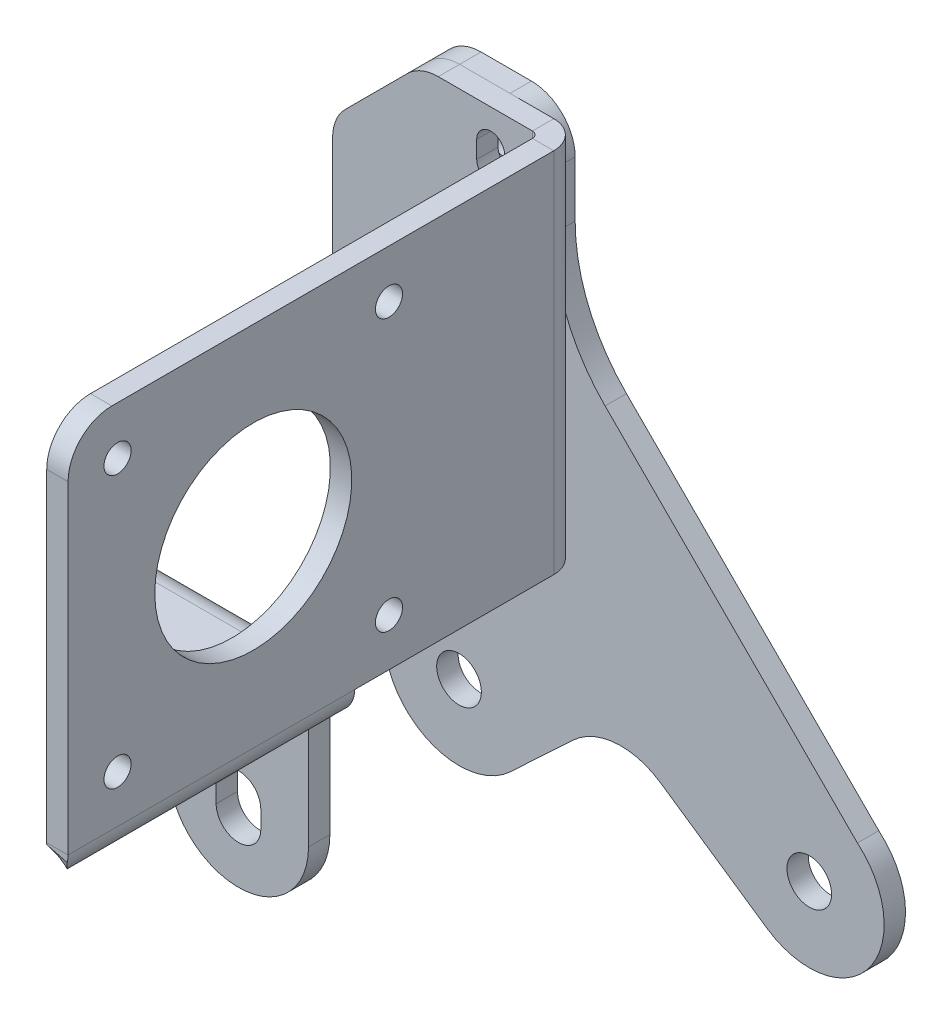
ISO-10303-21;
HEADER;
FILE_DESCRIPTION(('STEP AP214'),'2;1');
FILE_NAME('part.step','',(''),(''),'','','');
FILE_SCHEMA(('AUTOMOTIVE_DESIGN { 1 0 10303 214 1 1 1 1 }'));
ENDSEC;
DATA;
#1=APPLICATION_CONTEXT('core data for automotive mechanical design processes');
#2=APPLICATION_PROTOCOL_DEFINITION('international standard','automotive_design',2000,#1);
#3=PRODUCT_CONTEXT('',#1,'mechanical');
#4=PRODUCT('Part','Part','',(#3));
#5=PRODUCT_RELATED_PRODUCT_CATEGORY('part','',(#4));
#6=PRODUCT_DEFINITION_FORMATION('','',#4);
#7=PRODUCT_DEFINITION_CONTEXT('part definition',#1,'design');
#8=PRODUCT_DEFINITION('design','',#6,#7);
#9=PRODUCT_DEFINITION_SHAPE('','',#8);
#10=(LENGTH_UNIT() NAMED_UNIT(*) SI_UNIT(.MILLI.,.METRE.));
#11=(NAMED_UNIT(*) PLANE_ANGLE_UNIT() SI_UNIT($,.RADIAN.));
#12=(NAMED_UNIT(*) SI_UNIT($,.STERADIAN.) SOLID_ANGLE_UNIT());
#13=UNCERTAINTY_MEASURE_WITH_UNIT(LENGTH_MEASURE(1.E-05),#10,'distance_accuracy_value','');
#14=(GEOMETRIC_REPRESENTATION_CONTEXT(3) GLOBAL_UNCERTAINTY_ASSIGNED_CONTEXT((#13)) GLOBAL_UNIT_ASSIGNED_CONTEXT((#10,
#11,#12)) REPRESENTATION_CONTEXT('',''));
#15=CARTESIAN_POINT('',(0.,0.,0.));
#16=DIRECTION('',(0.,0.,1.));
#17=DIRECTION('',(1.,0.,0.));
#18=AXIS2_PLACEMENT_3D('',#15,#16,#17);
#19=CARTESIAN_POINT('',(-5.99999999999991,0.,0.));
#20=DIRECTION('',(-1.,0.,0.));
#21=DIRECTION('',(0.,0.,1.));
#22=AXIS2_PLACEMENT_3D('',#19,#20,#21);
#23=PLANE('',#22);
#24=CARTESIAN_POINT('',(-5.99999999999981,44.4536550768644,30.25));
#25=DIRECTION('',(-1.,0.,0.));
#26=DIRECTION('',(0.,0.,1.));
#27=AXIS2_PLACEMENT_3D('',#24,#25,#26);
#28=CIRCLE('',#27,1.55);
#29=CARTESIAN_POINT('',(-5.99999999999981,44.4536550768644,31.8));
#30=VERTEX_POINT('',#29);
#31=EDGE_CURVE('E557',#30,#30,#28,.F.);
#32=ORIENTED_EDGE('',*,*,#31,.F.);
#33=EDGE_LOOP('',(#32));
#34=FACE_BOUND('',#33,.T.);
#35=CARTESIAN_POINT('',(-5.99999999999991,44.4536550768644,-0.749999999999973));
#36=DIRECTION('',(-1.,0.,0.));
#37=DIRECTION('',(0.,0.,1.));
#38=AXIS2_PLACEMENT_3D('',#35,#36,#37);
#39=CIRCLE('',#38,1.55);
#40=CARTESIAN_POINT('',(-5.99999999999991,44.4536550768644,0.800000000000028));
#41=VERTEX_POINT('',#40);
#42=EDGE_CURVE('E551',#41,#41,#39,.F.);
#43=ORIENTED_EDGE('',*,*,#42,.F.);
#44=EDGE_LOOP('',(#43));
#45=FACE_BOUND('',#44,.T.);
#46=CARTESIAN_POINT('',(-5.99999999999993,75.4536550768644,-0.749999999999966));
#47=DIRECTION('',(-1.,0.,0.));
#48=DIRECTION('',(0.,0.,1.));
#49=AXIS2_PLACEMENT_3D('',#46,#47,#48);
#50=CIRCLE('',#49,1.55);
#51=CARTESIAN_POINT('',(-5.99999999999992,75.4536550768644,0.800000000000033));
#52=VERTEX_POINT('',#51);
#53=EDGE_CURVE('E544',#52,#52,#50,.F.);
#54=ORIENTED_EDGE('',*,*,#53,.F.);
#55=EDGE_LOOP('',(#54));
#56=FACE_BOUND('',#55,.T.);
#57=CARTESIAN_POINT('',(-5.99999999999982,75.4536550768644,30.25));
#58=DIRECTION('',(-1.,0.,0.));
#59=DIRECTION('',(0.,0.,1.));
#60=AXIS2_PLACEMENT_3D('',#57,#58,#59);
#61=CIRCLE('',#60,1.55);
#62=CARTESIAN_POINT('',(-5.99999999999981,75.4536550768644,31.8));
#63=VERTEX_POINT('',#62);
#64=EDGE_CURVE('E543',#63,#63,#61,.F.);
#65=ORIENTED_EDGE('',*,*,#64,.F.);
#66=EDGE_LOOP('',(#65));
#67=FACE_BOUND('',#66,.T.);
#68=CARTESIAN_POINT('',(-5.99999999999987,59.9536550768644,14.75));
#69=DIRECTION('',(-1.,0.,0.));
#70=DIRECTION('',(0.,0.,1.));
#71=AXIS2_PLACEMENT_3D('',#68,#69,#70);
#72=CIRCLE('',#71,11.25);
#73=CARTESIAN_POINT('',(-5.99999999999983,59.9536550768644,26.));
#74=VERTEX_POINT('',#73);
#75=EDGE_CURVE('E566',#74,#74,#72,.F.);
#76=ORIENTED_EDGE('',*,*,#75,.F.);
#77=EDGE_LOOP('',(#76));
#78=FACE_BOUND('',#77,.T.);
#79=DIRECTION('',(0.,0.,1.));
#80=VECTOR('',#79,1.);
#81=CARTESIAN_POINT('',(-5.99999999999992,80.9536550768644,0.));
#82=LINE('',#81,#80);
#83=CARTESIAN_POINT('',(-5.9999999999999,80.9536550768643,-19.5734));
#84=VERTEX_POINT('',#83);
#85=CARTESIAN_POINT('',(-5.99999999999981,80.9536550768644,30.8999999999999));
#86=VERTEX_POINT('',#85);
#87=EDGE_CURVE('E627',#84,#86,#82,.T.);
#88=ORIENTED_EDGE('',*,*,#87,.T.);
#89=CARTESIAN_POINT('',(-5.99999999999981,75.9536550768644,30.8999999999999));
#90=DIRECTION('',(-1.,0.,0.));
#91=DIRECTION('',(0.,0.,1.));
#92=AXIS2_PLACEMENT_3D('',#89,#90,#91);
#93=CIRCLE('',#92,5.);
#94=CARTESIAN_POINT('',(-5.9999999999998,75.9536550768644,35.8999999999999));
#95=VERTEX_POINT('',#94);
#96=EDGE_CURVE('E762',#86,#95,#93,.F.);
#97=ORIENTED_EDGE('',*,*,#96,.T.);
#98=DIRECTION('',(0.,-1.,0.));
#99=VECTOR('',#98,1.);
#100=CARTESIAN_POINT('',(-5.99999999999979,0.,35.8999999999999));
#101=LINE('',#100,#99);
#102=CARTESIAN_POINT('',(-5.99999999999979,39.0302550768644,35.8999999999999));
#103=VERTEX_POINT('',#102);
#104=EDGE_CURVE('E630',#95,#103,#101,.T.);
#105=ORIENTED_EDGE('',*,*,#104,.T.);
#106=DIRECTION('',(0.,0.,1.));
#107=VECTOR('',#106,1.);
#108=CARTESIAN_POINT('',(-5.99999999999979,39.0302550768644,35.8999999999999));
#109=LINE('',#108,#107);
#110=CARTESIAN_POINT('',(-5.99999999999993,39.0302550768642,3.1766));
#111=VERTEX_POINT('',#110);
#112=EDGE_CURVE('E646',#103,#111,#109,.F.);
#113=ORIENTED_EDGE('',*,*,#112,.T.);
#114=DIRECTION('',(0.,0.,-1.));
#115=VECTOR('',#114,1.);
#116=CARTESIAN_POINT('',(-5.99999999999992,39.0302550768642,2.81205733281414E-13));
#117=LINE('',#116,#115);
#118=CARTESIAN_POINT('',(-5.99999999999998,39.0302550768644,-19.5734));
#119=VERTEX_POINT('',#118);
#120=EDGE_CURVE('E631',#111,#119,#117,.T.);
#121=ORIENTED_EDGE('',*,*,#120,.T.);
#122=DIRECTION('',(0.,-1.,0.));
#123=VECTOR('',#122,1.);
#124=CARTESIAN_POINT('',(-5.99999999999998,39.0302550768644,-19.5734));
#125=LINE('',#124,#123);
#126=EDGE_CURVE('E597',#119,#84,#125,.F.);
#127=ORIENTED_EDGE('',*,*,#126,.T.);
#128=EDGE_LOOP('',(#88,#97,#105,#113,#121,#127));
#129=FACE_BOUND('',#128,.T.);
#130=ADVANCED_FACE('F130',(#34,#45,#56,#67,#78,#129),#23,.F.);
#131=CARTESIAN_POINT('',(-8.43999999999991,0.,0.));
#132=DIRECTION('',(-1.,0.,0.));
#133=DIRECTION('',(0.,0.,1.));
#134=AXIS2_PLACEMENT_3D('',#131,#132,#133);
#135=PLANE('',#134);
#136=CARTESIAN_POINT('',(-8.43999999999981,44.4536550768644,30.25));
#137=DIRECTION('',(-1.,0.,0.));
#138=DIRECTION('',(0.,0.,1.));
#139=AXIS2_PLACEMENT_3D('',#136,#137,#138);
#140=CIRCLE('',#139,1.55);
#141=CARTESIAN_POINT('',(-8.43999999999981,44.4536550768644,31.8));
#142=VERTEX_POINT('',#141);
#143=EDGE_CURVE('E501',#142,#142,#140,.T.);
#144=ORIENTED_EDGE('',*,*,#143,.F.);
#145=EDGE_LOOP('',(#144));
#146=FACE_BOUND('',#145,.T.);
#147=CARTESIAN_POINT('',(-8.43999999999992,44.4536550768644,-0.749999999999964));
#148=DIRECTION('',(-1.,0.,0.));
#149=DIRECTION('',(0.,0.,1.));
#150=AXIS2_PLACEMENT_3D('',#147,#148,#149);
#151=CIRCLE('',#150,1.55);
#152=CARTESIAN_POINT('',(-8.43999999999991,44.4536550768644,0.800000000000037));
#153=VERTEX_POINT('',#152);
#154=EDGE_CURVE('E554',#153,#153,#151,.T.);
#155=ORIENTED_EDGE('',*,*,#154,.F.);
#156=EDGE_LOOP('',(#155));
#157=FACE_BOUND('',#156,.T.);
#158=CARTESIAN_POINT('',(-8.43999999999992,75.4536550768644,-0.749999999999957));
#159=DIRECTION('',(-1.,0.,0.));
#160=DIRECTION('',(0.,0.,1.));
#161=AXIS2_PLACEMENT_3D('',#158,#159,#160);
#162=CIRCLE('',#161,1.55);
#163=CARTESIAN_POINT('',(-8.43999999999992,75.4536550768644,0.800000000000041));
#164=VERTEX_POINT('',#163);
#165=EDGE_CURVE('E548',#164,#164,#162,.T.);
#166=ORIENTED_EDGE('',*,*,#165,.F.);
#167=EDGE_LOOP('',(#166));
#168=FACE_BOUND('',#167,.T.);
#169=CARTESIAN_POINT('',(-8.43999999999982,75.4536550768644,30.25));
#170=DIRECTION('',(-1.,0.,0.));
#171=DIRECTION('',(0.,0.,1.));
#172=AXIS2_PLACEMENT_3D('',#169,#170,#171);
#173=CIRCLE('',#172,1.55);
#174=CARTESIAN_POINT('',(-8.43999999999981,75.4536550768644,31.8));
#175=VERTEX_POINT('',#174);
#176=EDGE_CURVE('E540',#175,#175,#173,.T.);
#177=ORIENTED_EDGE('',*,*,#176,.F.);
#178=EDGE_LOOP('',(#177));
#179=FACE_BOUND('',#178,.T.);
#180=CARTESIAN_POINT('',(-8.43999999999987,59.9536550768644,14.75));
#181=DIRECTION('',(-1.,0.,0.));
#182=DIRECTION('',(0.,0.,1.));
#183=AXIS2_PLACEMENT_3D('',#180,#181,#182);
#184=CIRCLE('',#183,11.25);
#185=CARTESIAN_POINT('',(-8.43999999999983,59.9536550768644,26.));
#186=VERTEX_POINT('',#185);
#187=EDGE_CURVE('E547',#186,#186,#184,.T.);
#188=ORIENTED_EDGE('',*,*,#187,.F.);
#189=EDGE_LOOP('',(#188));
#190=FACE_BOUND('',#189,.T.);
#191=DIRECTION('',(0.,1.,0.));
#192=VECTOR('',#191,1.);
#193=CARTESIAN_POINT('',(-8.43999999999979,35.8536550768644,35.8999999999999));
#194=LINE('',#193,#192);
#195=CARTESIAN_POINT('',(-8.4399999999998,75.9536550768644,35.8999999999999));
#196=VERTEX_POINT('',#195);
#197=CARTESIAN_POINT('',(-8.43999999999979,39.0302550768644,35.8999999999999));
#198=VERTEX_POINT('',#197);
#199=EDGE_CURVE('E624',#196,#198,#194,.F.);
#200=ORIENTED_EDGE('',*,*,#199,.F.);
#201=CARTESIAN_POINT('',(-8.43999999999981,75.9536550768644,30.8999999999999));
#202=DIRECTION('',(-1.,0.,0.));
#203=DIRECTION('',(0.,0.,1.));
#204=AXIS2_PLACEMENT_3D('',#201,#202,#203);
#205=CIRCLE('',#204,5.);
#206=CARTESIAN_POINT('',(-8.43999999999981,80.9536550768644,30.8999999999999));
#207=VERTEX_POINT('',#206);
#208=EDGE_CURVE('E758',#196,#207,#205,.T.);
#209=ORIENTED_EDGE('',*,*,#208,.T.);
#210=DIRECTION('',(0.,0.,-1.));
#211=VECTOR('',#210,1.);
#212=CARTESIAN_POINT('',(-8.4399999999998,80.9536550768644,35.8999999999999));
#213=LINE('',#212,#211);
#214=CARTESIAN_POINT('',(-8.43999999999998,80.9536550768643,-19.5734));
#215=VERTEX_POINT('',#214);
#216=EDGE_CURVE('E620',#215,#207,#213,.F.);
#217=ORIENTED_EDGE('',*,*,#216,.F.);
#218=DIRECTION('',(0.,-1.,0.));
#219=VECTOR('',#218,1.);
#220=CARTESIAN_POINT('',(-8.43999999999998,39.0302550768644,-19.5734));
#221=LINE('',#220,#219);
#222=CARTESIAN_POINT('',(-8.43999999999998,39.0302550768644,-19.5734));
#223=VERTEX_POINT('',#222);
#224=EDGE_CURVE('E609',#223,#215,#221,.F.);
#225=ORIENTED_EDGE('',*,*,#224,.F.);
#226=DIRECTION('',(0.,0.,1.));
#227=VECTOR('',#226,1.);
#228=CARTESIAN_POINT('',(-8.43999999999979,39.0302550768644,35.8999999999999));
#229=LINE('',#228,#227);
#230=CARTESIAN_POINT('',(-8.43999999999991,39.0302550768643,3.17660000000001));
#231=VERTEX_POINT('',#230);
#232=EDGE_CURVE('E682',#231,#223,#229,.F.);
#233=ORIENTED_EDGE('',*,*,#232,.F.);
#234=DIRECTION('',(0.,0.,1.));
#235=VECTOR('',#234,1.);
#236=CARTESIAN_POINT('',(-8.43999999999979,39.0302550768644,35.8999999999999));
#237=LINE('',#236,#235);
#238=EDGE_CURVE('E638',#198,#231,#237,.F.);
#239=ORIENTED_EDGE('',*,*,#238,.F.);
#240=EDGE_LOOP('',(#200,#209,#217,#225,#233,#239));
#241=FACE_BOUND('',#240,.T.);
#242=ADVANCED_FACE('F838',(#146,#157,#168,#179,#190,#241),#135,.T.);
#243=CARTESIAN_POINT('',(-5.9999999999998,80.9536550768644,35.8999999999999));
#244=DIRECTION('',(0.,-1.,0.));
#245=DIRECTION('',(1.,0.,0.));
#246=AXIS2_PLACEMENT_3D('',#243,#244,#245);
#247=PLANE('',#246);
#248=ORIENTED_EDGE('',*,*,#216,.T.);
#249=DIRECTION('',(-1.,0.,0.));
#250=VECTOR('',#249,1.);
#251=CARTESIAN_POINT('',(-5.99999999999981,80.9536550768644,30.8999999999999));
#252=LINE('',#251,#250);
#253=EDGE_CURVE('E760',#207,#86,#252,.F.);
#254=ORIENTED_EDGE('',*,*,#253,.T.);
#255=ORIENTED_EDGE('',*,*,#87,.F.);
#256=DIRECTION('',(1.,0.,0.));
#257=VECTOR('',#256,1.);
#258=CARTESIAN_POINT('',(-8.43999999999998,80.9536550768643,-19.5734));
#259=LINE('',#258,#257);
#260=EDGE_CURVE('E614',#215,#84,#259,.T.);
#261=ORIENTED_EDGE('',*,*,#260,.F.);
#262=EDGE_LOOP('',(#248,#254,#255,#261));
#263=FACE_BOUND('',#262,.T.);
#264=ADVANCED_FACE('F861',(#263),#247,.F.);
#265=CARTESIAN_POINT('',(-5.99999999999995,39.0302550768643,-11.0066999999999));
#266=DIRECTION('',(0.,-1.,0.));
#267=DIRECTION('',(0.,0.,-1.));
#268=AXIS2_PLACEMENT_3D('',#265,#266,#267);
#269=PLANE('',#268);
#270=ORIENTED_EDGE('',*,*,#232,.T.);
#271=DIRECTION('',(1.,0.,0.));
#272=VECTOR('',#271,1.);
#273=CARTESIAN_POINT('',(-8.43999999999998,39.0302550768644,-19.5734));
#274=LINE('',#273,#272);
#275=EDGE_CURVE('E603',#223,#119,#274,.T.);
#276=ORIENTED_EDGE('',*,*,#275,.T.);
#277=ORIENTED_EDGE('',*,*,#120,.F.);
#278=DIRECTION('',(1.,0.,0.));
#279=VECTOR('',#278,1.);
#280=CARTESIAN_POINT('',(-5.99999999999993,39.0302550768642,3.1766));
#281=LINE('',#280,#279);
#282=EDGE_CURVE('E733',#111,#231,#281,.F.);
#283=ORIENTED_EDGE('',*,*,#282,.T.);
#284=EDGE_LOOP('',(#270,#276,#277,#283));
#285=FACE_BOUND('',#284,.T.);
#286=ADVANCED_FACE('F842',(#285),#269,.T.);
#287=CARTESIAN_POINT('',(-9.17659999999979,39.0302550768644,35.8999999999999));
#288=DIRECTION('',(0.,0.,1.));
#289=DIRECTION('',(0.,-1.,0.));
#290=AXIS2_PLACEMENT_3D('',#287,#288,#289);
#291=CYLINDRICAL_SURFACE('',#290,3.1766);
#292=DIRECTION('',(0.,0.,1.));
#293=VECTOR('',#292,1.);
#294=CARTESIAN_POINT('',(-9.17659999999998,35.8536550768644,-22.0133999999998));
#295=LINE('',#294,#293);
#296=CARTESIAN_POINT('',(-9.17659999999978,35.8536550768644,32.8234000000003));
#297=VERTEX_POINT('',#296);
#298=CARTESIAN_POINT('',(-9.17659999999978,35.8536550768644,3.1766));
#299=VERTEX_POINT('',#298);
#300=EDGE_CURVE('E617',#297,#299,#295,.F.);
#301=ORIENTED_EDGE('',*,*,#300,.T.);
#302=CARTESIAN_POINT('',(-9.17659999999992,39.0302550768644,3.1766));
#303=DIRECTION('',(0.,0.,-1.));
#304=DIRECTION('',(0.,1.,0.));
#305=AXIS2_PLACEMENT_3D('',#302,#303,#304);
#306=CIRCLE('',#305,3.17659999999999);
#307=EDGE_CURVE('E742',#111,#299,#306,.T.);
#308=ORIENTED_EDGE('',*,*,#307,.F.);
#309=ORIENTED_EDGE('',*,*,#112,.F.);
#310=CARTESIAN_POINT('',(-9.17659999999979,39.0302550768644,35.8999999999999));
#311=DIRECTION('',(0.,0.,1.));
#312=DIRECTION('',(1.,0.,0.));
#313=AXIS2_PLACEMENT_3D('',#310,#311,#312);
#314=CIRCLE('',#313,3.1766);
#315=CARTESIAN_POINT('',(-6.10000000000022,38.2394833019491,35.8999999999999));
#316=VERTEX_POINT('',#315);
#317=EDGE_CURVE('E643',#316,#103,#314,.T.);
#318=ORIENTED_EDGE('',*,*,#317,.F.);
#319=CARTESIAN_POINT('',(-9.1765999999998,39.0302550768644,32.8234000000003));
#320=DIRECTION('',(0.707106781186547,0.,-0.707106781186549));
#321=DIRECTION('',(0.707106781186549,0.,0.707106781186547));
#322=AXIS2_PLACEMENT_3D('',#319,#320,#321);
#323=ELLIPSE('',#322,4.49239080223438,3.1766);
#324=EDGE_CURVE('E670',#297,#316,#323,.F.);
#325=ORIENTED_EDGE('',*,*,#324,.F.);
#326=EDGE_LOOP('',(#301,#308,#309,#318,#325));
#327=FACE_BOUND('',#326,.T.);
#328=ADVANCED_FACE('F866',(#327),#291,.T.);
#329=CARTESIAN_POINT('',(-9.17659999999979,39.0302550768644,35.8999999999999));
#330=DIRECTION('',(0.,0.,1.));
#331=DIRECTION('',(0.,-1.,0.));
#332=AXIS2_PLACEMENT_3D('',#329,#330,#331);
#333=CYLINDRICAL_SURFACE('',#332,0.736599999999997);
#334=CARTESIAN_POINT('',(-9.17659999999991,39.0302550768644,3.17660000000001));
#335=DIRECTION('',(0.,0.,1.));
#336=DIRECTION('',(1.,0.,0.));
#337=AXIS2_PLACEMENT_3D('',#334,#335,#336);
#338=CIRCLE('',#337,0.736599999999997);
#339=CARTESIAN_POINT('',(-9.17659999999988,38.2936550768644,3.17660000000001));
#340=VERTEX_POINT('',#339);
#341=EDGE_CURVE('E653',#231,#340,#338,.F.);
#342=ORIENTED_EDGE('',*,*,#341,.T.);
#343=DIRECTION('',(0.,0.,1.));
#344=VECTOR('',#343,1.);
#345=CARTESIAN_POINT('',(-9.17659999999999,38.2936550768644,-22.0133999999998));
#346=LINE('',#345,#344);
#347=CARTESIAN_POINT('',(-9.1765999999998,38.2936550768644,32.8234000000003));
#348=VERTEX_POINT('',#347);
#349=EDGE_CURVE('E650',#340,#348,#346,.T.);
#350=ORIENTED_EDGE('',*,*,#349,.T.);
#351=CARTESIAN_POINT('',(-9.1765999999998,39.0302550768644,32.8234000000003));
#352=DIRECTION('',(0.974152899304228,0.,-0.225889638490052));
#353=DIRECTION('',(0.225889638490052,0.,0.974152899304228));
#354=AXIS2_PLACEMENT_3D('',#351,#352,#353);
#355=ELLIPSE('',#354,3.2608844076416,0.736599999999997);
#356=CARTESIAN_POINT('',(-8.46318831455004,38.8468884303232,35.8999999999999));
#357=VERTEX_POINT('',#356);
#358=EDGE_CURVE('E639',#348,#357,#355,.F.);
#359=ORIENTED_EDGE('',*,*,#358,.T.);
#360=CARTESIAN_POINT('',(-9.17659999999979,39.0302550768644,35.8999999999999));
#361=DIRECTION('',(0.,0.,1.));
#362=DIRECTION('',(1.,0.,0.));
#363=AXIS2_PLACEMENT_3D('',#360,#361,#362);
#364=CIRCLE('',#363,0.736599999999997);
#365=EDGE_CURVE('E635',#357,#198,#364,.T.);
#366=ORIENTED_EDGE('',*,*,#365,.T.);
#367=ORIENTED_EDGE('',*,*,#238,.T.);
#368=EDGE_LOOP('',(#342,#350,#359,#366,#367));
#369=FACE_BOUND('',#368,.T.);
#370=ADVANCED_FACE('F847',(#369),#333,.F.);
#371=CARTESIAN_POINT('',(-9.17659999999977,35.1170550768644,3.1766));
#372=DIRECTION('',(1.,0.,0.));
#373=DIRECTION('',(0.,0.,-1.));
#374=AXIS2_PLACEMENT_3D('',#371,#372,#373);
#375=CYLINDRICAL_SURFACE('',#374,3.1766);
#376=DIRECTION('',(1.,0.,0.));
#377=VECTOR('',#376,1.);
#378=CARTESIAN_POINT('',(-9.17659999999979,38.2936550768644,3.1766));
#379=LINE('',#378,#377);
#380=CARTESIAN_POINT('',(-12.,38.2936550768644,3.1766));
#381=VERTEX_POINT('',#380);
#382=CARTESIAN_POINT('',(-32.0000000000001,38.2936550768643,3.1766));
#383=VERTEX_POINT('',#382);
#384=EDGE_CURVE('E665',#381,#383,#379,.F.);
#385=ORIENTED_EDGE('',*,*,#384,.F.);
#386=CARTESIAN_POINT('',(-12.,35.1170550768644,3.1766));
#387=DIRECTION('',(-1.,0.,0.));
#388=DIRECTION('',(0.,0.,1.));
#389=AXIS2_PLACEMENT_3D('',#386,#387,#388);
#390=CIRCLE('',#389,3.1766);
#391=CARTESIAN_POINT('',(-12.,35.1170550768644,0.));
#392=VERTEX_POINT('',#391);
#393=EDGE_CURVE('E709',#392,#381,#390,.F.);
#394=ORIENTED_EDGE('',*,*,#393,.F.);
#395=DIRECTION('',(1.,0.,0.));
#396=VECTOR('',#395,1.);
#397=CARTESIAN_POINT('',(-32.,35.1170550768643,0.));
#398=LINE('',#397,#396);
#399=CARTESIAN_POINT('',(-32.,35.1170550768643,0.));
#400=VERTEX_POINT('',#399);
#401=EDGE_CURVE('E642',#392,#400,#398,.F.);
#402=ORIENTED_EDGE('',*,*,#401,.T.);
#403=CARTESIAN_POINT('',(-32.,35.1170550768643,3.1766));
#404=DIRECTION('',(1.,0.,0.));
#405=DIRECTION('',(0.,1.,0.));
#406=AXIS2_PLACEMENT_3D('',#403,#404,#405);
#407=CIRCLE('',#406,3.1766);
#408=EDGE_CURVE('E677',#383,#400,#407,.F.);
#409=ORIENTED_EDGE('',*,*,#408,.F.);
#410=EDGE_LOOP('',(#385,#394,#402,#409));
#411=FACE_BOUND('',#410,.T.);
#412=ADVANCED_FACE('F1321',(#411),#375,.T.);
#413=CARTESIAN_POINT('',(-9.17659999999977,35.1170550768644,3.1766));
#414=DIRECTION('',(1.,0.,0.));
#415=DIRECTION('',(0.,0.,-1.));
#416=AXIS2_PLACEMENT_3D('',#413,#414,#415);
#417=CYLINDRICAL_SURFACE('',#416,0.7366);
#418=CARTESIAN_POINT('',(-12.,35.1170550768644,3.1766));
#419=DIRECTION('',(1.,0.,0.));
#420=DIRECTION('',(0.,1.,0.));
#421=AXIS2_PLACEMENT_3D('',#418,#419,#420);
#422=CIRCLE('',#421,0.7366);
#423=CARTESIAN_POINT('',(-12.,35.1170550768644,2.44));
#424=VERTEX_POINT('',#423);
#425=CARTESIAN_POINT('',(-12.,35.8536550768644,3.1766));
#426=VERTEX_POINT('',#425);
#427=EDGE_CURVE('E703',#424,#426,#422,.T.);
#428=ORIENTED_EDGE('',*,*,#427,.T.);
#429=DIRECTION('',(1.,0.,0.));
#430=VECTOR('',#429,1.);
#431=CARTESIAN_POINT('',(-9.17659999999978,35.8536550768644,3.1766));
#432=LINE('',#431,#430);
#433=CARTESIAN_POINT('',(-32.,35.8536550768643,3.1766));
#434=VERTEX_POINT('',#433);
#435=EDGE_CURVE('E683',#426,#434,#432,.F.);
#436=ORIENTED_EDGE('',*,*,#435,.T.);
#437=CARTESIAN_POINT('',(-32.,35.1170550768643,3.1766));
#438=DIRECTION('',(1.,0.,0.));
#439=DIRECTION('',(0.,1.,0.));
#440=AXIS2_PLACEMENT_3D('',#437,#438,#439);
#441=CIRCLE('',#440,0.7366);
#442=CARTESIAN_POINT('',(-32.,35.1170550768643,2.44));
#443=VERTEX_POINT('',#442);
#444=EDGE_CURVE('E684',#434,#443,#441,.F.);
#445=ORIENTED_EDGE('',*,*,#444,.T.);
#446=DIRECTION('',(1.,0.,0.));
#447=VECTOR('',#446,1.);
#448=CARTESIAN_POINT('',(-32.,35.1170550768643,2.44));
#449=LINE('',#448,#447);
#450=EDGE_CURVE('E687',#443,#424,#449,.T.);
#451=ORIENTED_EDGE('',*,*,#450,.T.);
#452=EDGE_LOOP('',(#428,#436,#445,#451));
#453=FACE_BOUND('',#452,.T.);
#454=ADVANCED_FACE('F1327',(#453),#417,.F.);
#455=CARTESIAN_POINT('',(-32.,35.8536550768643,0.));
#456=DIRECTION('',(1.,0.,0.));
#457=DIRECTION('',(0.,1.,0.));
#458=AXIS2_PLACEMENT_3D('',#455,#456,#457);
#459=PLANE('',#458);
#460=DIRECTION('',(0.,0.,-1.));
#461=VECTOR('',#460,1.);
#462=CARTESIAN_POINT('',(-31.9999999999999,32.1170550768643,0.));
#463=LINE('',#462,#461);
#464=CARTESIAN_POINT('',(-31.9999999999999,32.1170550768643,0.));
#465=VERTEX_POINT('',#464);
#466=CARTESIAN_POINT('',(-31.9999999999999,32.1170550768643,2.43999999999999));
#467=VERTEX_POINT('',#466);
#468=EDGE_CURVE('E700',#465,#467,#463,.F.);
#469=ORIENTED_EDGE('',*,*,#468,.T.);
#470=DIRECTION('',(0.,-1.,0.));
#471=VECTOR('',#470,1.);
#472=CARTESIAN_POINT('',(-32.,35.8536550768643,2.44));
#473=LINE('',#472,#471);
#474=EDGE_CURVE('E697',#467,#443,#473,.F.);
#475=ORIENTED_EDGE('',*,*,#474,.T.);
#476=DIRECTION('',(0.,0.,1.));
#477=VECTOR('',#476,1.);
#478=CARTESIAN_POINT('',(-32.,35.1170550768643,0.));
#479=LINE('',#478,#477);
#480=EDGE_CURVE('E694',#443,#400,#479,.F.);
#481=ORIENTED_EDGE('',*,*,#480,.T.);
#482=DIRECTION('',(0.,1.,0.));
#483=VECTOR('',#482,1.);
#484=CARTESIAN_POINT('',(-31.9999999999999,-1.01339371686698E-13,-1.25333771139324E-13));
#485=LINE('',#484,#483);
#486=EDGE_CURVE('E690',#465,#400,#485,.T.);
#487=ORIENTED_EDGE('',*,*,#486,.F.);
#488=EDGE_LOOP('',(#469,#475,#481,#487));
#489=FACE_BOUND('',#488,.T.);
#490=ADVANCED_FACE('F1290',(#489),#459,.F.);
#491=CARTESIAN_POINT('',(-1.23514223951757E-13,35.8536550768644,0.));
#492=DIRECTION('',(0.,1.,0.));
#493=DIRECTION('',(-1.,0.,0.));
#494=AXIS2_PLACEMENT_3D('',#491,#492,#493);
#495=PLANE('',#494);
#496=DIRECTION('',(0.707106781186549,0.,0.707106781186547));
#497=VECTOR('',#496,1.);
#498=CARTESIAN_POINT('',(-32.0000000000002,35.8536550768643,10.));
#499=LINE('',#498,#497);
#500=CARTESIAN_POINT('',(-30.5355339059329,35.8536550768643,11.4644660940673));
#501=VERTEX_POINT('',#500);
#502=EDGE_CURVE('E623',#501,#297,#499,.T.);
#503=ORIENTED_EDGE('',*,*,#502,.F.);
#504=CARTESIAN_POINT('',(-27.0000000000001,35.8536550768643,7.92893218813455));
#505=DIRECTION('',(0.,1.,0.));
#506=DIRECTION('',(-1.,0.,0.));
#507=AXIS2_PLACEMENT_3D('',#504,#505,#506);
#508=CIRCLE('',#507,5.);
#509=CARTESIAN_POINT('',(-32.,35.8536550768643,7.92893218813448));
#510=VERTEX_POINT('',#509);
#511=EDGE_CURVE('E767',#501,#510,#508,.F.);
#512=ORIENTED_EDGE('',*,*,#511,.T.);
#513=DIRECTION('',(0.,0.,1.));
#514=VECTOR('',#513,1.);
#515=CARTESIAN_POINT('',(-32.,35.8536550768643,0.));
#516=LINE('',#515,#514);
#517=EDGE_CURVE('E667',#434,#510,#516,.T.);
#518=ORIENTED_EDGE('',*,*,#517,.F.);
#519=ORIENTED_EDGE('',*,*,#435,.F.);
#520=EDGE_CURVE('E678',#299,#426,#432,.F.);
#521=ORIENTED_EDGE('',*,*,#520,.F.);
#522=ORIENTED_EDGE('',*,*,#300,.F.);
#523=EDGE_LOOP('',(#503,#512,#518,#519,#521,#522));
#524=FACE_BOUND('',#523,.T.);
#525=ADVANCED_FACE('F897',(#524),#495,.F.);
#526=CARTESIAN_POINT('',(-1.32408846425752E-13,38.2936550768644,0.));
#527=DIRECTION('',(0.,1.,0.));
#528=DIRECTION('',(-1.,0.,0.));
#529=AXIS2_PLACEMENT_3D('',#526,#527,#528);
#530=PLANE('',#529);
#531=DIRECTION('',(0.,0.,1.));
#532=VECTOR('',#531,1.);
#533=CARTESIAN_POINT('',(-32.,38.2936550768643,0.));
#534=LINE('',#533,#532);
#535=CARTESIAN_POINT('',(-32.0000000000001,38.2936550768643,7.92893218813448));
#536=VERTEX_POINT('',#535);
#537=EDGE_CURVE('E662',#383,#536,#534,.T.);
#538=ORIENTED_EDGE('',*,*,#537,.T.);
#539=CARTESIAN_POINT('',(-27.0000000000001,38.2936550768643,7.92893218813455));
#540=DIRECTION('',(0.,1.,0.));
#541=DIRECTION('',(-1.,0.,0.));
#542=AXIS2_PLACEMENT_3D('',#539,#540,#541);
#543=CIRCLE('',#542,5.);
#544=CARTESIAN_POINT('',(-30.5355339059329,38.2936550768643,11.4644660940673));
#545=VERTEX_POINT('',#544);
#546=EDGE_CURVE('E771',#536,#545,#543,.T.);
#547=ORIENTED_EDGE('',*,*,#546,.T.);
#548=DIRECTION('',(0.707106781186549,0.,0.707106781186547));
#549=VECTOR('',#548,1.);
#550=CARTESIAN_POINT('',(-32.0000000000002,38.2936550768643,10.));
#551=LINE('',#550,#549);
#552=EDGE_CURVE('E647',#545,#348,#551,.T.);
#553=ORIENTED_EDGE('',*,*,#552,.T.);
#554=ORIENTED_EDGE('',*,*,#349,.F.);
#555=EDGE_CURVE('E691',#340,#381,#379,.F.);
#556=ORIENTED_EDGE('',*,*,#555,.T.);
#557=ORIENTED_EDGE('',*,*,#384,.T.);
#558=EDGE_LOOP('',(#538,#547,#553,#554,#556,#557));
#559=FACE_BOUND('',#558,.T.);
#560=ADVANCED_FACE('F876',(#559),#530,.T.);
#561=CARTESIAN_POINT('',(-9.17659999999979,39.0302550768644,35.8999999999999));
#562=DIRECTION('',(0.,0.,-1.));
#563=DIRECTION('',(-1.,0.,0.));
#564=AXIS2_PLACEMENT_3D('',#561,#562,#563);
#565=PLANE('',#564);
#566=ORIENTED_EDGE('',*,*,#365,.F.);
#567=DIRECTION('',(0.968519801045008,-0.248936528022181,0.));
#568=VECTOR('',#567,1.);
#569=CARTESIAN_POINT('',(-6.10000000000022,38.2394833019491,35.8999999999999));
#570=LINE('',#569,#568);
#571=EDGE_CURVE('E660',#316,#357,#570,.F.);
#572=ORIENTED_EDGE('',*,*,#571,.F.);
#573=ORIENTED_EDGE('',*,*,#317,.T.);
#574=DIRECTION('',(1.,0.,0.));
#575=VECTOR('',#574,1.);
#576=CARTESIAN_POINT('',(-8.43999999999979,39.0302550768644,35.8999999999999));
#577=LINE('',#576,#575);
#578=EDGE_CURVE('E626',#198,#103,#577,.T.);
#579=ORIENTED_EDGE('',*,*,#578,.F.);
#580=EDGE_LOOP('',(#566,#572,#573,#579));
#581=FACE_BOUND('',#580,.T.);
#582=ADVANCED_FACE('F889',(#581),#565,.F.);
#583=CARTESIAN_POINT('',(-5.99999999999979,35.8536550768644,35.8999999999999));
#584=DIRECTION('',(0.,0.,-1.));
#585=DIRECTION('',(-1.,0.,0.));
#586=AXIS2_PLACEMENT_3D('',#583,#584,#585);
#587=PLANE('',#586);
#588=ORIENTED_EDGE('',*,*,#104,.F.);
#589=DIRECTION('',(-1.,0.,0.));
#590=VECTOR('',#589,1.);
#591=CARTESIAN_POINT('',(-5.9999999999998,75.9536550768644,35.8999999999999));
#592=LINE('',#591,#590);
#593=EDGE_CURVE('E755',#95,#196,#592,.T.);
#594=ORIENTED_EDGE('',*,*,#593,.T.);
#595=ORIENTED_EDGE('',*,*,#199,.T.);
#596=ORIENTED_EDGE('',*,*,#578,.T.);
#597=EDGE_LOOP('',(#588,#594,#595,#596));
#598=FACE_BOUND('',#597,.T.);
#599=ADVANCED_FACE('F853',(#598),#587,.F.);
#600=CARTESIAN_POINT('',(-32.0000000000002,38.2936550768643,10.));
#601=DIRECTION('',(-0.707106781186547,0.,0.707106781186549));
#602=DIRECTION('',(0.707106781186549,0.,0.707106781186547));
#603=AXIS2_PLACEMENT_3D('',#600,#601,#602);
#604=PLANE('',#603);
#605=ORIENTED_EDGE('',*,*,#552,.F.);
#606=DIRECTION('',(0.,-1.,0.));
#607=VECTOR('',#606,1.);
#608=CARTESIAN_POINT('',(-30.5355339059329,38.2936550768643,11.4644660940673));
#609=LINE('',#608,#607);
#610=EDGE_CURVE('E764',#545,#501,#609,.T.);
#611=ORIENTED_EDGE('',*,*,#610,.T.);
#612=ORIENTED_EDGE('',*,*,#502,.T.);
#613=DIRECTION('',(0.,1.,0.));
#614=VECTOR('',#613,1.);
#615=CARTESIAN_POINT('',(-9.1765999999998,38.2936550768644,32.8234000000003));
#616=LINE('',#615,#614);
#617=EDGE_CURVE('E656',#348,#297,#616,.F.);
#618=ORIENTED_EDGE('',*,*,#617,.F.);
#619=EDGE_LOOP('',(#605,#611,#612,#618));
#620=FACE_BOUND('',#619,.T.);
#621=ADVANCED_FACE('F882',(#620),#604,.T.);
#622=CARTESIAN_POINT('',(-32.,38.2936550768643,0.));
#623=DIRECTION('',(-1.,0.,0.));
#624=DIRECTION('',(0.,0.,1.));
#625=AXIS2_PLACEMENT_3D('',#622,#623,#624);
#626=PLANE('',#625);
#627=ORIENTED_EDGE('',*,*,#517,.T.);
#628=DIRECTION('',(0.,-1.,0.));
#629=VECTOR('',#628,1.);
#630=CARTESIAN_POINT('',(-32.0000000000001,38.2936550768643,7.92893218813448));
#631=LINE('',#630,#629);
#632=EDGE_CURVE('E769',#510,#536,#631,.F.);
#633=ORIENTED_EDGE('',*,*,#632,.T.);
#634=ORIENTED_EDGE('',*,*,#537,.F.);
#635=DIRECTION('',(0.,1.,0.));
#636=VECTOR('',#635,1.);
#637=CARTESIAN_POINT('',(-32.,35.8536550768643,3.1766));
#638=LINE('',#637,#636);
#639=EDGE_CURVE('E659',#434,#383,#638,.T.);
#640=ORIENTED_EDGE('',*,*,#639,.F.);
#641=EDGE_LOOP('',(#627,#633,#634,#640));
#642=FACE_BOUND('',#641,.T.);
#643=ADVANCED_FACE('F1255',(#642),#626,.T.);
#644=CARTESIAN_POINT('',(-5.99999999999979,39.0302550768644,36.0000000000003));
#645=CARTESIAN_POINT('',(-6.81333333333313,39.0302550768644,36.0000000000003));
#646=CARTESIAN_POINT('',(-7.62666666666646,39.0302550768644,36.0000000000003));
#647=CARTESIAN_POINT('',(-8.43999999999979,39.0302550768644,36.0000000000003));
#648=CARTESIAN_POINT('',(-5.99999999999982,45.3834550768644,36.0000000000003));
#649=CARTESIAN_POINT('',(-6.81333333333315,43.7567884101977,36.0000000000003));
#650=CARTESIAN_POINT('',(-7.62666666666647,42.1301217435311,36.0000000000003));
#651=CARTESIAN_POINT('',(-8.4399999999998,40.5034550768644,36.0000000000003));
#652=CARTESIAN_POINT('',(-12.3531999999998,45.3834550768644,29.6468000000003));
#653=CARTESIAN_POINT('',(-11.5398666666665,43.7567884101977,29.6468000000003));
#654=CARTESIAN_POINT('',(-10.7265333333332,42.1301217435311,29.6468000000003));
#655=CARTESIAN_POINT('',(-9.91319999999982,40.5034550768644,29.6468000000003));
#656=CARTESIAN_POINT('',(-12.3531999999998,39.0302550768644,29.6468000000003));
#657=CARTESIAN_POINT('',(-11.5398666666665,39.0302550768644,29.6468000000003));
#658=CARTESIAN_POINT('',(-10.7265333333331,39.0302550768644,29.6468000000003));
#659=CARTESIAN_POINT('',(-9.91319999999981,39.0302550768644,29.6468000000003));
#660=CARTESIAN_POINT('',(-12.3531999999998,32.6770550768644,29.6468000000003));
#661=CARTESIAN_POINT('',(-11.5398666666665,34.3037217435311,29.6468000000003));
#662=CARTESIAN_POINT('',(-10.7265333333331,35.9303884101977,29.6468000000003));
#663=CARTESIAN_POINT('',(-9.9131999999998,37.5570550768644,29.6468000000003));
#664=CARTESIAN_POINT('',(-5.99999999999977,32.6770550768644,36.0000000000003));
#665=CARTESIAN_POINT('',(-6.81333333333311,34.3037217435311,36.0000000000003));
#666=CARTESIAN_POINT('',(-7.62666666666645,35.9303884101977,36.0000000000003));
#667=CARTESIAN_POINT('',(-8.43999999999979,37.5570550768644,36.0000000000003));
#668=CARTESIAN_POINT('',(-5.99999999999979,39.0302550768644,36.0000000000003));
#669=CARTESIAN_POINT('',(-6.81333333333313,39.0302550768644,36.0000000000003));
#670=CARTESIAN_POINT('',(-7.62666666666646,39.0302550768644,36.0000000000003));
#671=CARTESIAN_POINT('',(-8.43999999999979,39.0302550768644,36.0000000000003));
#672=(BOUNDED_SURFACE() B_SPLINE_SURFACE(3,3,((#644,#645,#646,#647),(#648,#649,#650,#651),(#652,
#653,#654,#655),(#656,#657,#658,#659),(#660,#661,#662,#663),(#664,#665,#666,#667),(#668,#669,
#670,#671)),.UNSPECIFIED.,.T.,.F.,.F.) B_SPLINE_SURFACE_WITH_KNOTS((4,3,4),(4,4),(0.,0.5,1.),
(0.,1.),.UNSPECIFIED.) GEOMETRIC_REPRESENTATION_ITEM() RATIONAL_B_SPLINE_SURFACE(((1.,1.,1.,1.),
(0.333333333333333,0.333333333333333,0.333333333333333,0.333333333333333),(0.333333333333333,
0.333333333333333,0.333333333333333,0.333333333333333),(1.,1.,1.,1.),(0.333333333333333,
0.333333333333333,0.333333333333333,0.333333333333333),(0.333333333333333,0.333333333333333,
0.333333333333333,0.333333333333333),(1.,1.,1.,1.))) REPRESENTATION_ITEM('') SURFACE());
#673=ORIENTED_EDGE('',*,*,#324,.T.);
#674=ORIENTED_EDGE('',*,*,#571,.T.);
#675=ORIENTED_EDGE('',*,*,#358,.F.);
#676=ORIENTED_EDGE('',*,*,#617,.T.);
#677=EDGE_LOOP('',(#673,#674,#675,#676));
#678=FACE_BOUND('',#677,.T.);
#679=ADVANCED_FACE('F886',(#678),#672,.T.);
#680=CARTESIAN_POINT('',(-32.,35.1170550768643,3.1766));
#681=DIRECTION('',(-1.,0.,0.));
#682=DIRECTION('',(0.,-1.,0.));
#683=AXIS2_PLACEMENT_3D('',#680,#681,#682);
#684=PLANE('',#683);
#685=ORIENTED_EDGE('',*,*,#480,.F.);
#686=ORIENTED_EDGE('',*,*,#444,.F.);
#687=ORIENTED_EDGE('',*,*,#639,.T.);
#688=ORIENTED_EDGE('',*,*,#408,.T.);
#689=EDGE_LOOP('',(#685,#686,#687,#688));
#690=FACE_BOUND('',#689,.T.);
#691=ADVANCED_FACE('F1239',(#690),#684,.T.);
#692=CARTESIAN_POINT('',(0.,0.,-1.25333771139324E-13));
#693=DIRECTION('',(0.,0.,1.));
#694=DIRECTION('',(0.,-1.,0.));
#695=AXIS2_PLACEMENT_3D('',#692,#693,#694);
#696=PLANE('',#695);
#697=DIRECTION('',(0.289959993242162,-0.957038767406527,0.));
#698=VECTOR('',#697,1.);
#699=CARTESIAN_POINT('',(-27.6563101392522,17.7803200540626,0.));
#700=LINE('',#699,#698);
#701=CARTESIAN_POINT('',(-27.6563101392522,17.7803200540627,0.));
#702=VERTEX_POINT('',#701);
#703=EDGE_CURVE('E717',#465,#702,#700,.T.);
#704=ORIENTED_EDGE('',*,*,#703,.F.);
#705=ORIENTED_EDGE('',*,*,#486,.T.);
#706=ORIENTED_EDGE('',*,*,#401,.F.);
#707=DIRECTION('',(0.,1.,0.));
#708=VECTOR('',#707,1.);
#709=CARTESIAN_POINT('',(-12.,20.0999999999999,0.));
#710=LINE('',#709,#708);
#711=CARTESIAN_POINT('',(-12.,20.1,0.));
#712=VERTEX_POINT('',#711);
#713=EDGE_CURVE('E710',#712,#392,#710,.T.);
#714=ORIENTED_EDGE('',*,*,#713,.F.);
#715=CARTESIAN_POINT('',(-20.,20.1,0.));
#716=DIRECTION('',(0.,0.,1.));
#717=DIRECTION('',(0.,-1.,0.));
#718=AXIS2_PLACEMENT_3D('',#715,#716,#717);
#719=CIRCLE('',#718,8.);
#720=EDGE_CURVE('E716',#702,#712,#719,.T.);
#721=ORIENTED_EDGE('',*,*,#720,.F.);
#722=EDGE_LOOP('',(#704,#705,#706,#714,#721));
#723=FACE_BOUND('',#722,.T.);
#724=DIRECTION('',(0.,1.,0.));
#725=VECTOR('',#724,1.);
#726=CARTESIAN_POINT('',(-22.55,19.0999999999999,0.));
#727=LINE('',#726,#725);
#728=CARTESIAN_POINT('',(-22.55,19.1,0.));
#729=VERTEX_POINT('',#728);
#730=CARTESIAN_POINT('',(-22.55,21.1,0.));
#731=VERTEX_POINT('',#730);
#732=EDGE_CURVE('E435',#729,#731,#727,.T.);
#733=ORIENTED_EDGE('',*,*,#732,.F.);
#734=CARTESIAN_POINT('',(-20.,19.1,0.));
#735=DIRECTION('',(0.,0.,1.));
#736=DIRECTION('',(0.,-1.,0.));
#737=AXIS2_PLACEMENT_3D('',#734,#735,#736);
#738=CIRCLE('',#737,2.55);
#739=CARTESIAN_POINT('',(-17.45,19.1,0.));
#740=VERTEX_POINT('',#739);
#741=EDGE_CURVE('E421',#740,#729,#738,.F.);
#742=ORIENTED_EDGE('',*,*,#741,.F.);
#743=DIRECTION('',(0.,-1.,0.));
#744=VECTOR('',#743,1.);
#745=CARTESIAN_POINT('',(-17.45,19.0999999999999,0.));
#746=LINE('',#745,#744);
#747=CARTESIAN_POINT('',(-17.45,21.1,0.));
#748=VERTEX_POINT('',#747);
#749=EDGE_CURVE('E440',#748,#740,#746,.T.);
#750=ORIENTED_EDGE('',*,*,#749,.F.);
#751=CARTESIAN_POINT('',(-20.,21.1,0.));
#752=DIRECTION('',(0.,0.,1.));
#753=DIRECTION('',(0.,-1.,0.));
#754=AXIS2_PLACEMENT_3D('',#751,#752,#753);
#755=CIRCLE('',#754,2.55);
#756=EDGE_CURVE('E430',#731,#748,#755,.F.);
#757=ORIENTED_EDGE('',*,*,#756,.F.);
#758=EDGE_LOOP('',(#733,#742,#750,#757));
#759=FACE_BOUND('',#758,.T.);
#760=ADVANCED_FACE('F1230',(#723,#759),#696,.F.);
#761=CARTESIAN_POINT('',(0.,0.,2.43999999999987));
#762=DIRECTION('',(0.,0.,1.));
#763=DIRECTION('',(0.,-1.,0.));
#764=AXIS2_PLACEMENT_3D('',#761,#762,#763);
#765=PLANE('',#764);
#766=CARTESIAN_POINT('',(-20.,19.1,2.43999999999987));
#767=DIRECTION('',(0.,0.,1.));
#768=DIRECTION('',(1.,0.,0.));
#769=AXIS2_PLACEMENT_3D('',#766,#767,#768);
#770=CIRCLE('',#769,2.55);
#771=CARTESIAN_POINT('',(-22.55,19.1,2.43999999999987));
#772=VERTEX_POINT('',#771);
#773=CARTESIAN_POINT('',(-17.45,19.1,2.43999999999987));
#774=VERTEX_POINT('',#773);
#775=EDGE_CURVE('E419',#772,#774,#770,.T.);
#776=ORIENTED_EDGE('',*,*,#775,.F.);
#777=DIRECTION('',(0.,-1.,0.));
#778=VECTOR('',#777,1.);
#779=CARTESIAN_POINT('',(-22.55,19.1,2.43999999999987));
#780=LINE('',#779,#778);
#781=CARTESIAN_POINT('',(-22.55,21.1,2.43999999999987));
#782=VERTEX_POINT('',#781);
#783=EDGE_CURVE('E401',#782,#772,#780,.T.);
#784=ORIENTED_EDGE('',*,*,#783,.F.);
#785=CARTESIAN_POINT('',(-20.,21.1,2.43999999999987));
#786=DIRECTION('',(0.,0.,1.));
#787=DIRECTION('',(1.,0.,0.));
#788=AXIS2_PLACEMENT_3D('',#785,#786,#787);
#789=CIRCLE('',#788,2.55);
#790=CARTESIAN_POINT('',(-17.45,21.1,2.43999999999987));
#791=VERTEX_POINT('',#790);
#792=EDGE_CURVE('E412',#791,#782,#789,.T.);
#793=ORIENTED_EDGE('',*,*,#792,.F.);
#794=DIRECTION('',(0.,1.,0.));
#795=VECTOR('',#794,1.);
#796=CARTESIAN_POINT('',(-17.45,19.1,2.43999999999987));
#797=LINE('',#796,#795);
#798=EDGE_CURVE('E427',#774,#791,#797,.T.);
#799=ORIENTED_EDGE('',*,*,#798,.F.);
#800=EDGE_LOOP('',(#776,#784,#793,#799));
#801=FACE_BOUND('',#800,.T.);
#802=ORIENTED_EDGE('',*,*,#474,.F.);
#803=DIRECTION('',(0.289959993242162,-0.957038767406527,0.));
#804=VECTOR('',#803,1.);
#805=CARTESIAN_POINT('',(-27.6563101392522,17.7803200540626,2.43999999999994));
#806=LINE('',#805,#804);
#807=CARTESIAN_POINT('',(-27.6563101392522,17.7803200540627,2.43999999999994));
#808=VERTEX_POINT('',#807);
#809=EDGE_CURVE('E706',#467,#808,#806,.T.);
#810=ORIENTED_EDGE('',*,*,#809,.T.);
#811=CARTESIAN_POINT('',(-20.,20.1,2.43999999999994));
#812=DIRECTION('',(0.,0.,1.));
#813=DIRECTION('',(0.,-1.,0.));
#814=AXIS2_PLACEMENT_3D('',#811,#812,#813);
#815=CIRCLE('',#814,8.);
#816=CARTESIAN_POINT('',(-12.,20.1,2.43999999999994));
#817=VERTEX_POINT('',#816);
#818=EDGE_CURVE('E727',#808,#817,#815,.T.);
#819=ORIENTED_EDGE('',*,*,#818,.T.);
#820=DIRECTION('',(0.,-1.,0.));
#821=VECTOR('',#820,1.);
#822=CARTESIAN_POINT('',(-12.,0.,2.43999999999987));
#823=LINE('',#822,#821);
#824=EDGE_CURVE('E723',#817,#424,#823,.F.);
#825=ORIENTED_EDGE('',*,*,#824,.T.);
#826=ORIENTED_EDGE('',*,*,#450,.F.);
#827=EDGE_LOOP('',(#802,#810,#819,#825,#826));
#828=FACE_BOUND('',#827,.T.);
#829=ADVANCED_FACE('F424',(#801,#828),#765,.T.);
#830=CARTESIAN_POINT('',(-27.6563101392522,17.7803200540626,0.));
#831=DIRECTION('',(-0.957038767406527,-0.289959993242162,0.));
#832=DIRECTION('',(0.289959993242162,-0.957038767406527,0.));
#833=AXIS2_PLACEMENT_3D('',#830,#831,#832);
#834=PLANE('',#833);
#835=ORIENTED_EDGE('',*,*,#468,.F.);
#836=ORIENTED_EDGE('',*,*,#703,.T.);
#837=DIRECTION('',(0.,0.,-1.));
#838=VECTOR('',#837,1.);
#839=CARTESIAN_POINT('',(-27.6563101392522,17.7803200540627,0.));
#840=LINE('',#839,#838);
#841=EDGE_CURVE('E713',#702,#808,#840,.F.);
#842=ORIENTED_EDGE('',*,*,#841,.T.);
#843=ORIENTED_EDGE('',*,*,#809,.F.);
#844=EDGE_LOOP('',(#835,#836,#842,#843));
#845=FACE_BOUND('',#844,.T.);
#846=ADVANCED_FACE('F1214',(#845),#834,.T.);
#847=CARTESIAN_POINT('',(-20.,20.1,0.));
#848=DIRECTION('',(0.,0.,1.));
#849=DIRECTION('',(0.,-1.,0.));
#850=AXIS2_PLACEMENT_3D('',#847,#848,#849);
#851=CYLINDRICAL_SURFACE('',#850,8.);
#852=ORIENTED_EDGE('',*,*,#841,.F.);
#853=ORIENTED_EDGE('',*,*,#720,.T.);
#854=DIRECTION('',(0.,0.,-1.));
#855=VECTOR('',#854,1.);
#856=CARTESIAN_POINT('',(-12.,20.1,0.));
#857=LINE('',#856,#855);
#858=EDGE_CURVE('E718',#712,#817,#857,.F.);
#859=ORIENTED_EDGE('',*,*,#858,.T.);
#860=ORIENTED_EDGE('',*,*,#818,.F.);
#861=EDGE_LOOP('',(#852,#853,#859,#860));
#862=FACE_BOUND('',#861,.T.);
#863=ADVANCED_FACE('F1206',(#862),#851,.T.);
#864=CARTESIAN_POINT('',(-12.,20.0999999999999,0.));
#865=DIRECTION('',(1.,0.,0.));
#866=DIRECTION('',(0.,1.,0.));
#867=AXIS2_PLACEMENT_3D('',#864,#865,#866);
#868=PLANE('',#867);
#869=ORIENTED_EDGE('',*,*,#858,.F.);
#870=ORIENTED_EDGE('',*,*,#713,.T.);
#871=DIRECTION('',(0.,0.,-1.));
#872=VECTOR('',#871,1.);
#873=CARTESIAN_POINT('',(-12.,35.1170550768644,0.));
#874=LINE('',#873,#872);
#875=EDGE_CURVE('E707',#392,#424,#874,.F.);
#876=ORIENTED_EDGE('',*,*,#875,.T.);
#877=ORIENTED_EDGE('',*,*,#824,.F.);
#878=EDGE_LOOP('',(#869,#870,#876,#877));
#879=FACE_BOUND('',#878,.T.);
#880=ADVANCED_FACE('F1198',(#879),#868,.T.);
#881=CARTESIAN_POINT('',(-12.,35.1170550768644,3.1766));
#882=DIRECTION('',(1.,0.,0.));
#883=DIRECTION('',(0.,0.,-1.));
#884=AXIS2_PLACEMENT_3D('',#881,#882,#883);
#885=PLANE('',#884);
#886=ORIENTED_EDGE('',*,*,#393,.T.);
#887=DIRECTION('',(0.,-1.,0.));
#888=VECTOR('',#887,1.);
#889=CARTESIAN_POINT('',(-12.,35.8536550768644,3.1766));
#890=LINE('',#889,#888);
#891=EDGE_CURVE('E681',#426,#381,#890,.F.);
#892=ORIENTED_EDGE('',*,*,#891,.F.);
#893=ORIENTED_EDGE('',*,*,#427,.F.);
#894=ORIENTED_EDGE('',*,*,#875,.F.);
#895=EDGE_LOOP('',(#886,#892,#893,#894));
#896=FACE_BOUND('',#895,.T.);
#897=ADVANCED_FACE('F1191',(#896),#885,.T.);
#898=CARTESIAN_POINT('',(-10.5882999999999,35.8536550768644,3.1766));
#899=DIRECTION('',(0.,0.,1.));
#900=DIRECTION('',(1.,0.,0.));
#901=AXIS2_PLACEMENT_3D('',#898,#899,#900);
#902=PLANE('',#901);
#903=DIRECTION('',(0.,-1.,0.));
#904=VECTOR('',#903,1.);
#905=CARTESIAN_POINT('',(-9.17659999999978,35.8536550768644,3.1766));
#906=LINE('',#905,#904);
#907=EDGE_CURVE('E738',#299,#340,#906,.F.);
#908=ORIENTED_EDGE('',*,*,#907,.F.);
#909=ORIENTED_EDGE('',*,*,#520,.T.);
#910=ORIENTED_EDGE('',*,*,#891,.T.);
#911=ORIENTED_EDGE('',*,*,#555,.F.);
#912=EDGE_LOOP('',(#908,#909,#910,#911));
#913=FACE_BOUND('',#912,.T.);
#914=ADVANCED_FACE('F872',(#913),#902,.F.);
#915=CARTESIAN_POINT('',(-9.17659999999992,39.0302550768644,3.1766));
#916=DIRECTION('',(0.,0.,1.));
#917=DIRECTION('',(0.,-1.,0.));
#918=AXIS2_PLACEMENT_3D('',#915,#916,#917);
#919=PLANE('',#918);
#920=ORIENTED_EDGE('',*,*,#282,.F.);
#921=ORIENTED_EDGE('',*,*,#307,.T.);
#922=ORIENTED_EDGE('',*,*,#907,.T.);
#923=ORIENTED_EDGE('',*,*,#341,.F.);
#924=EDGE_LOOP('',(#920,#921,#922,#923));
#925=FACE_BOUND('',#924,.T.);
#926=ADVANCED_FACE('F870',(#925),#919,.F.);
#927=CARTESIAN_POINT('',(-9.17659999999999,80.9536550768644,-19.5734));
#928=DIRECTION('',(0.,1.,0.));
#929=DIRECTION('',(0.,0.,1.));
#930=AXIS2_PLACEMENT_3D('',#927,#928,#929);
#931=PLANE('',#930);
#932=DIRECTION('',(0.,0.,1.));
#933=VECTOR('',#932,1.);
#934=CARTESIAN_POINT('',(-9.17659999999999,80.9536550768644,-22.75));
#935=LINE('',#934,#933);
#936=CARTESIAN_POINT('',(-9.17659999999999,80.9536550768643,-20.31));
#937=VERTEX_POINT('',#936);
#938=CARTESIAN_POINT('',(-9.17659999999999,80.9536550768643,-22.75));
#939=VERTEX_POINT('',#938);
#940=EDGE_CURVE('E569',#937,#939,#935,.F.);
#941=ORIENTED_EDGE('',*,*,#940,.F.);
#942=CARTESIAN_POINT('',(-9.17659999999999,80.9536550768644,-19.5734));
#943=DIRECTION('',(0.,-1.,0.));
#944=DIRECTION('',(0.,0.,-1.));
#945=AXIS2_PLACEMENT_3D('',#942,#943,#944);
#946=CIRCLE('',#945,0.736600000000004);
#947=EDGE_CURVE('E606',#215,#937,#946,.F.);
#948=ORIENTED_EDGE('',*,*,#947,.F.);
#949=ORIENTED_EDGE('',*,*,#260,.T.);
#950=CARTESIAN_POINT('',(-9.17659999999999,80.9536550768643,-19.5734));
#951=DIRECTION('',(0.,-1.,0.));
#952=DIRECTION('',(0.,0.,-1.));
#953=AXIS2_PLACEMENT_3D('',#950,#951,#952);
#954=CIRCLE('',#953,3.1766);
#955=EDGE_CURVE('E599',#84,#939,#954,.F.);
#956=ORIENTED_EDGE('',*,*,#955,.T.);
#957=EDGE_LOOP('',(#941,#948,#949,#956));
#958=FACE_BOUND('',#957,.T.);
#959=ADVANCED_FACE('F828',(#958),#931,.T.);
#960=CARTESIAN_POINT('',(-9.17659999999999,39.0302550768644,-19.5734));
#961=DIRECTION('',(0.,1.,0.));
#962=DIRECTION('',(0.,0.,1.));
#963=AXIS2_PLACEMENT_3D('',#960,#961,#962);
#964=PLANE('',#963);
#965=CARTESIAN_POINT('',(-9.17659999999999,39.0302550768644,-19.5734));
#966=DIRECTION('',(0.,-1.,0.));
#967=DIRECTION('',(0.,0.,-1.));
#968=AXIS2_PLACEMENT_3D('',#965,#966,#967);
#969=CIRCLE('',#968,0.736600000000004);
#970=CARTESIAN_POINT('',(-9.17659999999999,39.0302550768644,-20.31));
#971=VERTEX_POINT('',#970);
#972=EDGE_CURVE('E572',#971,#223,#969,.T.);
#973=ORIENTED_EDGE('',*,*,#972,.F.);
#974=DIRECTION('',(0.,0.,1.));
#975=VECTOR('',#974,1.);
#976=CARTESIAN_POINT('',(-9.17659999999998,39.0302550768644,-20.31));
#977=LINE('',#976,#975);
#978=CARTESIAN_POINT('',(-9.17659999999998,39.0302550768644,-22.75));
#979=VERTEX_POINT('',#978);
#980=EDGE_CURVE('E590',#971,#979,#977,.F.);
#981=ORIENTED_EDGE('',*,*,#980,.T.);
#982=CARTESIAN_POINT('',(-9.17659999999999,39.0302550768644,-19.5734));
#983=DIRECTION('',(0.,-1.,0.));
#984=DIRECTION('',(0.,0.,-1.));
#985=AXIS2_PLACEMENT_3D('',#982,#983,#984);
#986=CIRCLE('',#985,3.1766);
#987=EDGE_CURVE('E600',#979,#119,#986,.T.);
#988=ORIENTED_EDGE('',*,*,#987,.T.);
#989=ORIENTED_EDGE('',*,*,#275,.F.);
#990=EDGE_LOOP('',(#973,#981,#988,#989));
#991=FACE_BOUND('',#990,.T.);
#992=ADVANCED_FACE('F820',(#991),#964,.F.);
#993=CARTESIAN_POINT('',(-9.17659999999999,39.0302550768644,-19.5734));
#994=DIRECTION('',(0.,-1.,0.));
#995=DIRECTION('',(0.,0.,-1.));
#996=AXIS2_PLACEMENT_3D('',#993,#994,#995);
#997=CYLINDRICAL_SURFACE('',#996,3.1766);
#998=ORIENTED_EDGE('',*,*,#126,.F.);
#999=ORIENTED_EDGE('',*,*,#987,.F.);
#1000=DIRECTION('',(0.,-1.,0.));
#1001=VECTOR('',#1000,1.);
#1002=CARTESIAN_POINT('',(-9.17659999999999,80.9536550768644,-22.75));
#1003=LINE('',#1002,#1001);
#1004=EDGE_CURVE('E587',#979,#939,#1003,.F.);
#1005=ORIENTED_EDGE('',*,*,#1004,.T.);
#1006=ORIENTED_EDGE('',*,*,#955,.F.);
#1007=EDGE_LOOP('',(#998,#999,#1005,#1006));
#1008=FACE_BOUND('',#1007,.T.);
#1009=ADVANCED_FACE('F825',(#1008),#997,.T.);
#1010=CARTESIAN_POINT('',(-9.17659999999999,39.0302550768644,-19.5734));
#1011=DIRECTION('',(0.,-1.,0.));
#1012=DIRECTION('',(0.,0.,-1.));
#1013=AXIS2_PLACEMENT_3D('',#1010,#1011,#1012);
#1014=CYLINDRICAL_SURFACE('',#1013,0.736600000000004);
#1015=ORIENTED_EDGE('',*,*,#224,.T.);
#1016=ORIENTED_EDGE('',*,*,#947,.T.);
#1017=DIRECTION('',(0.,-1.,0.));
#1018=VECTOR('',#1017,1.);
#1019=CARTESIAN_POINT('',(-9.17659999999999,80.9536550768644,-20.31));
#1020=LINE('',#1019,#1018);
#1021=EDGE_CURVE('E593',#937,#971,#1020,.T.);
#1022=ORIENTED_EDGE('',*,*,#1021,.T.);
#1023=ORIENTED_EDGE('',*,*,#972,.T.);
#1024=EDGE_LOOP('',(#1015,#1016,#1022,#1023));
#1025=FACE_BOUND('',#1024,.T.);
#1026=ADVANCED_FACE('F834',(#1025),#1014,.F.);
#1027=CARTESIAN_POINT('',(-32.,39.0302550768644,-22.75));
#1028=DIRECTION('',(0.,1.,0.));
#1029=DIRECTION('',(-1.,0.,0.));
#1030=AXIS2_PLACEMENT_3D('',#1027,#1028,#1029);
#1031=PLANE('',#1030);
#1032=DIRECTION('',(1.,0.,0.));
#1033=VECTOR('',#1032,1.);
#1034=CARTESIAN_POINT('',(-32.,39.0302550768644,-20.31));
#1035=LINE('',#1034,#1033);
#1036=CARTESIAN_POINT('',(-27.,39.0302550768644,-20.31));
#1037=VERTEX_POINT('',#1036);
#1038=EDGE_CURVE('E584',#971,#1037,#1035,.F.);
#1039=ORIENTED_EDGE('',*,*,#1038,.T.);
#1040=DIRECTION('',(0.,0.,1.));
#1041=VECTOR('',#1040,1.);
#1042=CARTESIAN_POINT('',(-27.,39.0302550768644,-22.75));
#1043=LINE('',#1042,#1041);
#1044=CARTESIAN_POINT('',(-27.,39.0302550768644,-22.75));
#1045=VERTEX_POINT('',#1044);
#1046=EDGE_CURVE('E785',#1037,#1045,#1043,.F.);
#1047=ORIENTED_EDGE('',*,*,#1046,.T.);
#1048=DIRECTION('',(-1.,0.,0.));
#1049=VECTOR('',#1048,1.);
#1050=CARTESIAN_POINT('',(0.,39.0302550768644,-22.75));
#1051=LINE('',#1050,#1049);
#1052=EDGE_CURVE('E576',#979,#1045,#1051,.T.);
#1053=ORIENTED_EDGE('',*,*,#1052,.F.);
#1054=ORIENTED_EDGE('',*,*,#980,.F.);
#1055=EDGE_LOOP('',(#1039,#1047,#1053,#1054));
#1056=FACE_BOUND('',#1055,.T.);
#1057=ADVANCED_FACE('F817',(#1056),#1031,.F.);
#1058=CARTESIAN_POINT('',(-8.43999999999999,80.9536550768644,-22.75));
#1059=DIRECTION('',(0.,-1.,0.));
#1060=DIRECTION('',(0.,0.,-1.));
#1061=AXIS2_PLACEMENT_3D('',#1058,#1059,#1060);
#1062=PLANE('',#1061);
#1063=DIRECTION('',(1.,0.,0.));
#1064=VECTOR('',#1063,1.);
#1065=CARTESIAN_POINT('',(0.,80.9536550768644,-22.75));
#1066=LINE('',#1065,#1064);
#1067=CARTESIAN_POINT('',(-19.9289321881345,80.9536550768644,-22.75));
#1068=VERTEX_POINT('',#1067);
#1069=EDGE_CURVE('E570',#1068,#939,#1066,.T.);
#1070=ORIENTED_EDGE('',*,*,#1069,.F.);
#1071=DIRECTION('',(0.,0.,-1.));
#1072=VECTOR('',#1071,1.);
#1073=CARTESIAN_POINT('',(-19.9289321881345,80.9536550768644,-20.31));
#1074=LINE('',#1073,#1072);
#1075=CARTESIAN_POINT('',(-19.9289321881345,80.9536550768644,-20.31));
#1076=VERTEX_POINT('',#1075);
#1077=EDGE_CURVE('E14',#1068,#1076,#1074,.F.);
#1078=ORIENTED_EDGE('',*,*,#1077,.T.);
#1079=DIRECTION('',(-1.,0.,0.));
#1080=VECTOR('',#1079,1.);
#1081=CARTESIAN_POINT('',(-8.43999999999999,80.9536550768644,-20.31));
#1082=LINE('',#1081,#1080);
#1083=EDGE_CURVE('E579',#1076,#937,#1082,.F.);
#1084=ORIENTED_EDGE('',*,*,#1083,.T.);
#1085=ORIENTED_EDGE('',*,*,#940,.T.);
#1086=EDGE_LOOP('',(#1070,#1078,#1084,#1085));
#1087=FACE_BOUND('',#1086,.T.);
#1088=ADVANCED_FACE('F831',(#1087),#1062,.F.);
#1089=CARTESIAN_POINT('',(0.,0.,-22.75));
#1090=DIRECTION('',(0.,0.,1.));
#1091=DIRECTION('',(0.,-1.,0.));
#1092=AXIS2_PLACEMENT_3D('',#1089,#1090,#1091);
#1093=PLANE('',#1092);
#1094=CARTESIAN_POINT('',(-28.,57.4564211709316,-22.75));
#1095=DIRECTION('',(0.,0.,1.));
#1096=DIRECTION('',(0.,-1.,0.));
#1097=AXIS2_PLACEMENT_3D('',#1094,#1095,#1096);
#1098=CIRCLE('',#1097,1.6);
#1099=CARTESIAN_POINT('',(-29.6,57.4564211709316,-22.75));
#1100=VERTEX_POINT('',#1099);
#1101=CARTESIAN_POINT('',(-26.4,57.4564211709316,-22.75));
#1102=VERTEX_POINT('',#1101);
#1103=EDGE_CURVE('E453',#1100,#1102,#1098,.F.);
#1104=ORIENTED_EDGE('',*,*,#1103,.F.);
#1105=DIRECTION('',(0.,1.,0.));
#1106=VECTOR('',#1105,1.);
#1107=CARTESIAN_POINT('',(-29.6,55.4564211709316,-22.75));
#1108=LINE('',#1107,#1106);
#1109=CARTESIAN_POINT('',(-29.6,55.4564211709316,-22.75));
#1110=VERTEX_POINT('',#1109);
#1111=EDGE_CURVE('E502',#1110,#1100,#1108,.T.);
#1112=ORIENTED_EDGE('',*,*,#1111,.F.);
#1113=CARTESIAN_POINT('',(-28.,55.4564211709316,-22.75));
#1114=DIRECTION('',(0.,0.,1.));
#1115=DIRECTION('',(0.,-1.,0.));
#1116=AXIS2_PLACEMENT_3D('',#1113,#1114,#1115);
#1117=CIRCLE('',#1116,1.6);
#1118=CARTESIAN_POINT('',(-26.4,55.4564211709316,-22.75));
#1119=VERTEX_POINT('',#1118);
#1120=EDGE_CURVE('E504',#1119,#1110,#1117,.F.);
#1121=ORIENTED_EDGE('',*,*,#1120,.F.);
#1122=DIRECTION('',(0.,-1.,0.));
#1123=VECTOR('',#1122,1.);
#1124=CARTESIAN_POINT('',(-26.4,55.4564211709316,-22.75));
#1125=LINE('',#1124,#1123);
#1126=EDGE_CURVE('E483',#1102,#1119,#1125,.T.);
#1127=ORIENTED_EDGE('',*,*,#1126,.F.);
#1128=EDGE_LOOP('',(#1104,#1112,#1121,#1127));
#1129=FACE_BOUND('',#1128,.T.);
#1130=CARTESIAN_POINT('',(-13.94,76.9536550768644,-22.75));
#1131=DIRECTION('',(0.,0.,1.));
#1132=DIRECTION('',(0.,-1.,0.));
#1133=AXIS2_PLACEMENT_3D('',#1130,#1131,#1132);
#1134=CIRCLE('',#1133,1.6);
#1135=CARTESIAN_POINT('',(-15.54,76.9536550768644,-22.75));
#1136=VERTEX_POINT('',#1135);
#1137=CARTESIAN_POINT('',(-12.34,76.9536550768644,-22.75));
#1138=VERTEX_POINT('',#1137);
#1139=EDGE_CURVE('E463',#1136,#1138,#1134,.F.);
#1140=ORIENTED_EDGE('',*,*,#1139,.F.);
#1141=DIRECTION('',(0.,1.,0.));
#1142=VECTOR('',#1141,1.);
#1143=CARTESIAN_POINT('',(-15.54,74.9536550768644,-22.75));
#1144=LINE('',#1143,#1142);
#1145=CARTESIAN_POINT('',(-15.54,74.9536550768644,-22.75));
#1146=VERTEX_POINT('',#1145);
#1147=EDGE_CURVE('E480',#1146,#1136,#1144,.T.);
#1148=ORIENTED_EDGE('',*,*,#1147,.F.);
#1149=CARTESIAN_POINT('',(-13.94,74.9536550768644,-22.75));
#1150=DIRECTION('',(0.,0.,1.));
#1151=DIRECTION('',(0.,-1.,0.));
#1152=AXIS2_PLACEMENT_3D('',#1149,#1150,#1151);
#1153=CIRCLE('',#1152,1.6);
#1154=CARTESIAN_POINT('',(-12.34,74.9536550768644,-22.75));
#1155=VERTEX_POINT('',#1154);
#1156=EDGE_CURVE('E482',#1155,#1146,#1153,.F.);
#1157=ORIENTED_EDGE('',*,*,#1156,.F.);
#1158=DIRECTION('',(0.,-1.,0.));
#1159=VECTOR('',#1158,1.);
#1160=CARTESIAN_POINT('',(-12.34,74.9536550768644,-22.75));
#1161=LINE('',#1160,#1159);
#1162=EDGE_CURVE('E497',#1138,#1155,#1161,.T.);
#1163=ORIENTED_EDGE('',*,*,#1162,.F.);
#1164=EDGE_LOOP('',(#1140,#1148,#1157,#1163));
#1165=FACE_BOUND('',#1164,.T.);
#1166=CARTESIAN_POINT('',(-13.94,45.0302550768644,-22.75));
#1167=DIRECTION('',(0.,0.,1.));
#1168=DIRECTION('',(0.,-1.,0.));
#1169=AXIS2_PLACEMENT_3D('',#1166,#1167,#1168);
#1170=CIRCLE('',#1169,1.6);
#1171=CARTESIAN_POINT('',(-15.54,45.0302550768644,-22.75));
#1172=VERTEX_POINT('',#1171);
#1173=CARTESIAN_POINT('',(-12.34,45.0302550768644,-22.75));
#1174=VERTEX_POINT('',#1173);
#1175=EDGE_CURVE('E443',#1172,#1174,#1170,.F.);
#1176=ORIENTED_EDGE('',*,*,#1175,.F.);
#1177=DIRECTION('',(0.,1.,0.));
#1178=VECTOR('',#1177,1.);
#1179=CARTESIAN_POINT('',(-15.54,43.0302550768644,-22.75));
#1180=LINE('',#1179,#1178);
#1181=CARTESIAN_POINT('',(-15.54,43.0302550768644,-22.75));
#1182=VERTEX_POINT('',#1181);
#1183=EDGE_CURVE('E466',#1182,#1172,#1180,.T.);
#1184=ORIENTED_EDGE('',*,*,#1183,.F.);
#1185=CARTESIAN_POINT('',(-13.94,43.0302550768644,-22.75));
#1186=DIRECTION('',(0.,0.,1.));
#1187=DIRECTION('',(0.,-1.,0.));
#1188=AXIS2_PLACEMENT_3D('',#1185,#1186,#1187);
#1189=CIRCLE('',#1188,1.6);
#1190=CARTESIAN_POINT('',(-12.34,43.0302550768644,-22.75));
#1191=VERTEX_POINT('',#1190);
#1192=EDGE_CURVE('E523',#1191,#1182,#1189,.F.);
#1193=ORIENTED_EDGE('',*,*,#1192,.F.);
#1194=DIRECTION('',(0.,-1.,0.));
#1195=VECTOR('',#1194,1.);
#1196=CARTESIAN_POINT('',(-12.34,43.0302550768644,-22.75));
#1197=LINE('',#1196,#1195);
#1198=EDGE_CURVE('E505',#1174,#1191,#1197,.T.);
#1199=ORIENTED_EDGE('',*,*,#1198,.F.);
#1200=EDGE_LOOP('',(#1176,#1184,#1193,#1199));
#1201=FACE_BOUND('',#1200,.T.);
#1202=ORIENTED_EDGE('',*,*,#1052,.T.);
#1203=CARTESIAN_POINT('',(-27.,44.0302550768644,-22.75));
#1204=DIRECTION('',(0.,0.,1.));
#1205=DIRECTION('',(0.,-1.,0.));
#1206=AXIS2_PLACEMENT_3D('',#1203,#1204,#1205);
#1207=CIRCLE('',#1206,5.);
#1208=CARTESIAN_POINT('',(-32.,44.0302550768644,-22.75));
#1209=VERTEX_POINT('',#1208);
#1210=EDGE_CURVE('E790',#1045,#1209,#1207,.F.);
#1211=ORIENTED_EDGE('',*,*,#1210,.T.);
#1212=DIRECTION('',(0.,1.,0.));
#1213=VECTOR('',#1212,1.);
#1214=CARTESIAN_POINT('',(-32.,0.,-22.75));
#1215=LINE('',#1214,#1213);
#1216=CARTESIAN_POINT('',(-32.,68.8825872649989,-22.75));
#1217=VERTEX_POINT('',#1216);
#1218=EDGE_CURVE('E573',#1209,#1217,#1215,.T.);
#1219=ORIENTED_EDGE('',*,*,#1218,.T.);
#1220=CARTESIAN_POINT('',(-27.,68.8825872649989,-22.75));
#1221=DIRECTION('',(0.,0.,1.));
#1222=DIRECTION('',(0.,-1.,0.));
#1223=AXIS2_PLACEMENT_3D('',#1220,#1221,#1222);
#1224=CIRCLE('',#1223,5.);
#1225=CARTESIAN_POINT('',(-30.5355339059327,72.4181211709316,-22.75));
#1226=VERTEX_POINT('',#1225);
#1227=EDGE_CURVE('E788',#1217,#1226,#1224,.F.);
#1228=ORIENTED_EDGE('',*,*,#1227,.T.);
#1229=DIRECTION('',(-0.707106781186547,-0.707106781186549,0.));
#1230=VECTOR('',#1229,1.);
#1231=CARTESIAN_POINT('',(-22.,80.9536550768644,-22.75));
#1232=LINE('',#1231,#1230);
#1233=CARTESIAN_POINT('',(-23.4644660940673,79.4891889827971,-22.75));
#1234=VERTEX_POINT('',#1233);
#1235=EDGE_CURVE('E753',#1226,#1234,#1232,.F.);
#1236=ORIENTED_EDGE('',*,*,#1235,.T.);
#1237=CARTESIAN_POINT('',(-19.9289321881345,75.9536550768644,-22.75));
#1238=DIRECTION('',(0.,0.,1.));
#1239=DIRECTION('',(0.,-1.,0.));
#1240=AXIS2_PLACEMENT_3D('',#1237,#1238,#1239);
#1241=CIRCLE('',#1240,5.);
#1242=EDGE_CURVE('E145',#1234,#1068,#1241,.F.);
#1243=ORIENTED_EDGE('',*,*,#1242,.T.);
#1244=ORIENTED_EDGE('',*,*,#1069,.T.);
#1245=ORIENTED_EDGE('',*,*,#1004,.F.);
#1246=EDGE_LOOP('',(#1202,#1211,#1219,#1228,#1236,#1243,#1244,#1245));
#1247=FACE_BOUND('',#1246,.T.);
#1248=ADVANCED_FACE('F806',(#1129,#1165,#1201,#1247),#1093,.F.);
#1249=CARTESIAN_POINT('',(0.,0.,-20.31));
#1250=DIRECTION('',(0.,0.,1.));
#1251=DIRECTION('',(0.,-1.,0.));
#1252=AXIS2_PLACEMENT_3D('',#1249,#1250,#1251);
#1253=PLANE('',#1252);
#1254=DIRECTION('',(0.,-1.,0.));
#1255=VECTOR('',#1254,1.);
#1256=CARTESIAN_POINT('',(-15.54,43.0302550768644,-20.31));
#1257=LINE('',#1256,#1255);
#1258=CARTESIAN_POINT('',(-15.54,45.0302550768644,-20.31));
#1259=VERTEX_POINT('',#1258);
#1260=CARTESIAN_POINT('',(-15.54,43.0302550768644,-20.31));
#1261=VERTEX_POINT('',#1260);
#1262=EDGE_CURVE('E531',#1259,#1261,#1257,.T.);
#1263=ORIENTED_EDGE('',*,*,#1262,.F.);
#1264=CARTESIAN_POINT('',(-13.94,45.0302550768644,-20.31));
#1265=DIRECTION('',(0.,0.,1.));
#1266=DIRECTION('',(1.,0.,0.));
#1267=AXIS2_PLACEMENT_3D('',#1264,#1265,#1266);
#1268=CIRCLE('',#1267,1.6);
#1269=CARTESIAN_POINT('',(-12.34,45.0302550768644,-20.31));
#1270=VERTEX_POINT('',#1269);
#1271=EDGE_CURVE('E447',#1270,#1259,#1268,.T.);
#1272=ORIENTED_EDGE('',*,*,#1271,.F.);
#1273=DIRECTION('',(0.,1.,0.));
#1274=VECTOR('',#1273,1.);
#1275=CARTESIAN_POINT('',(-12.34,43.0302550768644,-20.31));
#1276=LINE('',#1275,#1274);
#1277=CARTESIAN_POINT('',(-12.34,43.0302550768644,-20.31));
#1278=VERTEX_POINT('',#1277);
#1279=EDGE_CURVE('E529',#1278,#1270,#1276,.T.);
#1280=ORIENTED_EDGE('',*,*,#1279,.F.);
#1281=CARTESIAN_POINT('',(-13.94,43.0302550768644,-20.31));
#1282=DIRECTION('',(0.,0.,1.));
#1283=DIRECTION('',(1.,0.,0.));
#1284=AXIS2_PLACEMENT_3D('',#1281,#1282,#1283);
#1285=CIRCLE('',#1284,1.6);
#1286=EDGE_CURVE('E526',#1261,#1278,#1285,.T.);
#1287=ORIENTED_EDGE('',*,*,#1286,.F.);
#1288=EDGE_LOOP('',(#1263,#1272,#1280,#1287));
#1289=FACE_BOUND('',#1288,.T.);
#1290=DIRECTION('',(0.,-1.,0.));
#1291=VECTOR('',#1290,1.);
#1292=CARTESIAN_POINT('',(-15.54,74.9536550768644,-20.31));
#1293=LINE('',#1292,#1291);
#1294=CARTESIAN_POINT('',(-15.54,76.9536550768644,-20.31));
#1295=VERTEX_POINT('',#1294);
#1296=CARTESIAN_POINT('',(-15.54,74.9536550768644,-20.31));
#1297=VERTEX_POINT('',#1296);
#1298=EDGE_CURVE('E491',#1295,#1297,#1293,.T.);
#1299=ORIENTED_EDGE('',*,*,#1298,.F.);
#1300=CARTESIAN_POINT('',(-13.94,76.9536550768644,-20.31));
#1301=DIRECTION('',(0.,0.,1.));
#1302=DIRECTION('',(1.,0.,0.));
#1303=AXIS2_PLACEMENT_3D('',#1300,#1301,#1302);
#1304=CIRCLE('',#1303,1.6);
#1305=CARTESIAN_POINT('',(-12.34,76.9536550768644,-20.31));
#1306=VERTEX_POINT('',#1305);
#1307=EDGE_CURVE('E459',#1306,#1295,#1304,.T.);
#1308=ORIENTED_EDGE('',*,*,#1307,.F.);
#1309=DIRECTION('',(0.,1.,0.));
#1310=VECTOR('',#1309,1.);
#1311=CARTESIAN_POINT('',(-12.34,74.9536550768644,-20.31));
#1312=LINE('',#1311,#1310);
#1313=CARTESIAN_POINT('',(-12.34,74.9536550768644,-20.31));
#1314=VERTEX_POINT('',#1313);
#1315=EDGE_CURVE('E489',#1314,#1306,#1312,.T.);
#1316=ORIENTED_EDGE('',*,*,#1315,.F.);
#1317=CARTESIAN_POINT('',(-13.94,74.9536550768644,-20.31));
#1318=DIRECTION('',(0.,0.,1.));
#1319=DIRECTION('',(1.,0.,0.));
#1320=AXIS2_PLACEMENT_3D('',#1317,#1318,#1319);
#1321=CIRCLE('',#1320,1.6);
#1322=EDGE_CURVE('E486',#1297,#1314,#1321,.T.);
#1323=ORIENTED_EDGE('',*,*,#1322,.F.);
#1324=EDGE_LOOP('',(#1299,#1308,#1316,#1323));
#1325=FACE_BOUND('',#1324,.T.);
#1326=DIRECTION('',(0.,-1.,0.));
#1327=VECTOR('',#1326,1.);
#1328=CARTESIAN_POINT('',(-29.6,55.4564211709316,-20.31));
#1329=LINE('',#1328,#1327);
#1330=CARTESIAN_POINT('',(-29.6,57.4564211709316,-20.31));
#1331=VERTEX_POINT('',#1330);
#1332=CARTESIAN_POINT('',(-29.6,55.4564211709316,-20.31));
#1333=VERTEX_POINT('',#1332);
#1334=EDGE_CURVE('E513',#1331,#1333,#1329,.T.);
#1335=ORIENTED_EDGE('',*,*,#1334,.F.);
#1336=CARTESIAN_POINT('',(-28.,57.4564211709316,-20.31));
#1337=DIRECTION('',(0.,0.,1.));
#1338=DIRECTION('',(1.,0.,0.));
#1339=AXIS2_PLACEMENT_3D('',#1336,#1337,#1338);
#1340=CIRCLE('',#1339,1.6);
#1341=CARTESIAN_POINT('',(-26.4,57.4564211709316,-20.31));
#1342=VERTEX_POINT('',#1341);
#1343=EDGE_CURVE('E469',#1342,#1331,#1340,.T.);
#1344=ORIENTED_EDGE('',*,*,#1343,.F.);
#1345=DIRECTION('',(0.,1.,0.));
#1346=VECTOR('',#1345,1.);
#1347=CARTESIAN_POINT('',(-26.4,55.4564211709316,-20.31));
#1348=LINE('',#1347,#1346);
#1349=CARTESIAN_POINT('',(-26.4,55.4564211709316,-20.31));
#1350=VERTEX_POINT('',#1349);
#1351=EDGE_CURVE('E511',#1350,#1342,#1348,.T.);
#1352=ORIENTED_EDGE('',*,*,#1351,.F.);
#1353=CARTESIAN_POINT('',(-28.,55.4564211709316,-20.31));
#1354=DIRECTION('',(0.,0.,1.));
#1355=DIRECTION('',(1.,0.,0.));
#1356=AXIS2_PLACEMENT_3D('',#1353,#1354,#1355);
#1357=CIRCLE('',#1356,1.6);
#1358=EDGE_CURVE('E508',#1333,#1350,#1357,.T.);
#1359=ORIENTED_EDGE('',*,*,#1358,.F.);
#1360=EDGE_LOOP('',(#1335,#1344,#1352,#1359));
#1361=FACE_BOUND('',#1360,.T.);
#1362=DIRECTION('',(0.,-1.,0.));
#1363=VECTOR('',#1362,1.);
#1364=CARTESIAN_POINT('',(-32.,80.9536550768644,-20.31));
#1365=LINE('',#1364,#1363);
#1366=CARTESIAN_POINT('',(-32.,44.0302550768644,-20.31));
#1367=VERTEX_POINT('',#1366);
#1368=CARTESIAN_POINT('',(-32.,68.8825872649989,-20.31));
#1369=VERTEX_POINT('',#1368);
#1370=EDGE_CURVE('E581',#1367,#1369,#1365,.F.);
#1371=ORIENTED_EDGE('',*,*,#1370,.F.);
#1372=CARTESIAN_POINT('',(-27.,44.0302550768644,-20.31));
#1373=DIRECTION('',(0.,0.,1.));
#1374=DIRECTION('',(0.,-1.,0.));
#1375=AXIS2_PLACEMENT_3D('',#1372,#1373,#1374);
#1376=CIRCLE('',#1375,5.);
#1377=EDGE_CURVE('E783',#1367,#1037,#1376,.T.);
#1378=ORIENTED_EDGE('',*,*,#1377,.T.);
#1379=ORIENTED_EDGE('',*,*,#1038,.F.);
#1380=ORIENTED_EDGE('',*,*,#1021,.F.);
#1381=ORIENTED_EDGE('',*,*,#1083,.F.);
#1382=CARTESIAN_POINT('',(-19.9289321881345,75.9536550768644,-20.31));
#1383=DIRECTION('',(0.,0.,1.));
#1384=DIRECTION('',(0.,-1.,0.));
#1385=AXIS2_PLACEMENT_3D('',#1382,#1383,#1384);
#1386=CIRCLE('',#1385,5.);
#1387=CARTESIAN_POINT('',(-23.4644660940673,79.4891889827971,-20.31));
#1388=VERTEX_POINT('',#1387);
#1389=EDGE_CURVE('E779',#1076,#1388,#1386,.T.);
#1390=ORIENTED_EDGE('',*,*,#1389,.T.);
#1391=DIRECTION('',(0.707106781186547,0.707106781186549,0.));
#1392=VECTOR('',#1391,1.);
#1393=CARTESIAN_POINT('',(-51.4768275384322,51.4768275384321,-20.31));
#1394=LINE('',#1393,#1392);
#1395=CARTESIAN_POINT('',(-30.5355339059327,72.4181211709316,-20.31));
#1396=VERTEX_POINT('',#1395);
#1397=EDGE_CURVE('E741',#1388,#1396,#1394,.F.);
#1398=ORIENTED_EDGE('',*,*,#1397,.T.);
#1399=CARTESIAN_POINT('',(-27.,68.8825872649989,-20.31));
#1400=DIRECTION('',(0.,0.,1.));
#1401=DIRECTION('',(0.,-1.,0.));
#1402=AXIS2_PLACEMENT_3D('',#1399,#1400,#1401);
#1403=CIRCLE('',#1402,5.);
#1404=EDGE_CURVE('E781',#1396,#1369,#1403,.T.);
#1405=ORIENTED_EDGE('',*,*,#1404,.T.);
#1406=EDGE_LOOP('',(#1371,#1378,#1379,#1380,#1381,#1390,#1398,#1405));
#1407=FACE_BOUND('',#1406,.T.);
#1408=ADVANCED_FACE('F798',(#1289,#1325,#1361,#1407),#1253,.T.);
#1409=CARTESIAN_POINT('',(-32.,80.9536550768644,-22.75));
#1410=DIRECTION('',(1.,0.,0.));
#1411=DIRECTION('',(0.,1.,0.));
#1412=AXIS2_PLACEMENT_3D('',#1409,#1410,#1411);
#1413=PLANE('',#1412);
#1414=ORIENTED_EDGE('',*,*,#1218,.F.);
#1415=DIRECTION('',(0.,0.,1.));
#1416=VECTOR('',#1415,1.);
#1417=CARTESIAN_POINT('',(-32.,44.0302550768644,-22.75));
#1418=LINE('',#1417,#1416);
#1419=EDGE_CURVE('E776',#1209,#1367,#1418,.T.);
#1420=ORIENTED_EDGE('',*,*,#1419,.T.);
#1421=ORIENTED_EDGE('',*,*,#1370,.T.);
#1422=DIRECTION('',(0.,0.,1.));
#1423=VECTOR('',#1422,1.);
#1424=CARTESIAN_POINT('',(-32.,68.8825872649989,-22.75));
#1425=LINE('',#1424,#1423);
#1426=EDGE_CURVE('E773',#1369,#1217,#1425,.F.);
#1427=ORIENTED_EDGE('',*,*,#1426,.T.);
#1428=EDGE_LOOP('',(#1414,#1420,#1421,#1427));
#1429=FACE_BOUND('',#1428,.T.);
#1430=ADVANCED_FACE('F804',(#1429),#1413,.F.);
#1431=CARTESIAN_POINT('',(-22.,80.9536550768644,-22.75));
#1432=DIRECTION('',(0.707106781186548,-0.707106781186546,0.));
#1433=DIRECTION('',(0.,0.,1.));
#1434=AXIS2_PLACEMENT_3D('',#1431,#1432,#1433);
#1435=PLANE('',#1434);
#1436=ORIENTED_EDGE('',*,*,#1235,.F.);
#1437=DIRECTION('',(0.,0.,-1.));
#1438=VECTOR('',#1437,1.);
#1439=CARTESIAN_POINT('',(-30.5355339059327,72.4181211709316,-20.31));
#1440=LINE('',#1439,#1438);
#1441=EDGE_CURVE('E138',#1226,#1396,#1440,.F.);
#1442=ORIENTED_EDGE('',*,*,#1441,.T.);
#1443=ORIENTED_EDGE('',*,*,#1397,.F.);
#1444=DIRECTION('',(0.,0.,1.));
#1445=VECTOR('',#1444,1.);
#1446=CARTESIAN_POINT('',(-23.4644660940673,79.4891889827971,-22.75));
#1447=LINE('',#1446,#1445);
#1448=EDGE_CURVE('E153',#1388,#1234,#1447,.F.);
#1449=ORIENTED_EDGE('',*,*,#1448,.T.);
#1450=EDGE_LOOP('',(#1436,#1442,#1443,#1449));
#1451=FACE_BOUND('',#1450,.T.);
#1452=ADVANCED_FACE('F793',(#1451),#1435,.F.);
#1453=CARTESIAN_POINT('',(-5.99999999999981,75.9536550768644,30.8999999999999));
#1454=DIRECTION('',(-1.,0.,0.));
#1455=DIRECTION('',(0.,0.,1.));
#1456=AXIS2_PLACEMENT_3D('',#1453,#1454,#1455);
#1457=CYLINDRICAL_SURFACE('',#1456,5.);
#1458=ORIENTED_EDGE('',*,*,#96,.F.);
#1459=ORIENTED_EDGE('',*,*,#253,.F.);
#1460=ORIENTED_EDGE('',*,*,#208,.F.);
#1461=ORIENTED_EDGE('',*,*,#593,.F.);
#1462=EDGE_LOOP('',(#1458,#1459,#1460,#1461));
#1463=FACE_BOUND('',#1462,.T.);
#1464=ADVANCED_FACE('F857',(#1463),#1457,.T.);
#1465=CARTESIAN_POINT('',(-27.0000000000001,38.2936550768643,7.92893218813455));
#1466=DIRECTION('',(0.,-1.,0.));
#1467=DIRECTION('',(1.,0.,0.));
#1468=AXIS2_PLACEMENT_3D('',#1465,#1466,#1467);
#1469=CYLINDRICAL_SURFACE('',#1468,5.);
#1470=ORIENTED_EDGE('',*,*,#546,.F.);
#1471=ORIENTED_EDGE('',*,*,#632,.F.);
#1472=ORIENTED_EDGE('',*,*,#511,.F.);
#1473=ORIENTED_EDGE('',*,*,#610,.F.);
#1474=EDGE_LOOP('',(#1470,#1471,#1472,#1473));
#1475=FACE_BOUND('',#1474,.T.);
#1476=ADVANCED_FACE('F1114',(#1475),#1469,.T.);
#1477=CARTESIAN_POINT('',(-27.,44.0302550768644,-22.75));
#1478=DIRECTION('',(0.,0.,1.));
#1479=DIRECTION('',(0.,-1.,0.));
#1480=AXIS2_PLACEMENT_3D('',#1477,#1478,#1479);
#1481=CYLINDRICAL_SURFACE('',#1480,5.);
#1482=ORIENTED_EDGE('',*,*,#1210,.F.);
#1483=ORIENTED_EDGE('',*,*,#1046,.F.);
#1484=ORIENTED_EDGE('',*,*,#1377,.F.);
#1485=ORIENTED_EDGE('',*,*,#1419,.F.);
#1486=EDGE_LOOP('',(#1482,#1483,#1484,#1485));
#1487=FACE_BOUND('',#1486,.T.);
#1488=ADVANCED_FACE('F812',(#1487),#1481,.T.);
#1489=CARTESIAN_POINT('',(-27.,68.8825872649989,-22.75));
#1490=DIRECTION('',(0.,0.,-1.));
#1491=DIRECTION('',(0.,1.,0.));
#1492=AXIS2_PLACEMENT_3D('',#1489,#1490,#1491);
#1493=CYLINDRICAL_SURFACE('',#1492,5.);
#1494=ORIENTED_EDGE('',*,*,#1404,.F.);
#1495=ORIENTED_EDGE('',*,*,#1441,.F.);
#1496=ORIENTED_EDGE('',*,*,#1227,.F.);
#1497=ORIENTED_EDGE('',*,*,#1426,.F.);
#1498=EDGE_LOOP('',(#1494,#1495,#1496,#1497));
#1499=FACE_BOUND('',#1498,.T.);
#1500=ADVANCED_FACE('F801',(#1499),#1493,.T.);
#1501=CARTESIAN_POINT('',(-19.9289321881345,75.9536550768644,-22.75));
#1502=DIRECTION('',(0.,0.,1.));
#1503=DIRECTION('',(0.,-1.,0.));
#1504=AXIS2_PLACEMENT_3D('',#1501,#1502,#1503);
#1505=CYLINDRICAL_SURFACE('',#1504,5.);
#1506=ORIENTED_EDGE('',*,*,#1242,.F.);
#1507=ORIENTED_EDGE('',*,*,#1448,.F.);
#1508=ORIENTED_EDGE('',*,*,#1389,.F.);
#1509=ORIENTED_EDGE('',*,*,#1077,.F.);
#1510=EDGE_LOOP('',(#1506,#1507,#1508,#1509));
#1511=FACE_BOUND('',#1510,.T.);
#1512=ADVANCED_FACE('F132',(#1511),#1505,.T.);
#1513=CARTESIAN_POINT('',(25.8198051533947,59.9536550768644,14.7499999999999));
#1514=DIRECTION('',(-1.,0.,0.));
#1515=DIRECTION('',(0.,0.,1.));
#1516=AXIS2_PLACEMENT_3D('',#1513,#1514,#1515);
#1517=CYLINDRICAL_SURFACE('',#1516,11.25);
#1518=ORIENTED_EDGE('',*,*,#75,.T.);
#1519=EDGE_LOOP('',(#1518));
#1520=FACE_BOUND('',#1519,.T.);
#1521=ORIENTED_EDGE('',*,*,#187,.T.);
#1522=EDGE_LOOP('',(#1521));
#1523=FACE_BOUND('',#1522,.T.);
#1524=ADVANCED_FACE('F933',(#1520,#1523),#1517,.F.);
#1525=CARTESIAN_POINT('',(25.8198051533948,75.4536550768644,30.2499999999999));
#1526=DIRECTION('',(-1.,0.,0.));
#1527=DIRECTION('',(0.,0.,1.));
#1528=AXIS2_PLACEMENT_3D('',#1525,#1526,#1527);
#1529=CYLINDRICAL_SURFACE('',#1528,1.55);
#1530=ORIENTED_EDGE('',*,*,#64,.T.);
#1531=EDGE_LOOP('',(#1530));
#1532=FACE_BOUND('',#1531,.T.);
#1533=ORIENTED_EDGE('',*,*,#176,.T.);
#1534=EDGE_LOOP('',(#1533));
#1535=FACE_BOUND('',#1534,.T.);
#1536=ADVANCED_FACE('F936',(#1532,#1535),#1529,.F.);
#1537=CARTESIAN_POINT('',(25.8198051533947,75.4536550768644,-0.750000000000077));
#1538=DIRECTION('',(-1.,0.,0.));
#1539=DIRECTION('',(0.,0.,1.));
#1540=AXIS2_PLACEMENT_3D('',#1537,#1538,#1539);
#1541=CYLINDRICAL_SURFACE('',#1540,1.55);
#1542=ORIENTED_EDGE('',*,*,#53,.T.);
#1543=EDGE_LOOP('',(#1542));
#1544=FACE_BOUND('',#1543,.T.);
#1545=ORIENTED_EDGE('',*,*,#165,.T.);
#1546=EDGE_LOOP('',(#1545));
#1547=FACE_BOUND('',#1546,.T.);
#1548=ADVANCED_FACE('F946',(#1544,#1547),#1541,.F.);
#1549=CARTESIAN_POINT('',(25.8198051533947,44.4536550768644,-0.750000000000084));
#1550=DIRECTION('',(-1.,0.,0.));
#1551=DIRECTION('',(0.,0.,1.));
#1552=AXIS2_PLACEMENT_3D('',#1549,#1550,#1551);
#1553=CYLINDRICAL_SURFACE('',#1552,1.55);
#1554=ORIENTED_EDGE('',*,*,#42,.T.);
#1555=EDGE_LOOP('',(#1554));
#1556=FACE_BOUND('',#1555,.T.);
#1557=ORIENTED_EDGE('',*,*,#154,.T.);
#1558=EDGE_LOOP('',(#1557));
#1559=FACE_BOUND('',#1558,.T.);
#1560=ADVANCED_FACE('F942',(#1556,#1559),#1553,.F.);
#1561=CARTESIAN_POINT('',(25.8198051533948,44.4536550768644,30.2499999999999));
#1562=DIRECTION('',(-1.,0.,0.));
#1563=DIRECTION('',(0.,0.,1.));
#1564=AXIS2_PLACEMENT_3D('',#1561,#1562,#1563);
#1565=CYLINDRICAL_SURFACE('',#1564,1.55);
#1566=ORIENTED_EDGE('',*,*,#31,.T.);
#1567=EDGE_LOOP('',(#1566));
#1568=FACE_BOUND('',#1567,.T.);
#1569=ORIENTED_EDGE('',*,*,#143,.T.);
#1570=EDGE_LOOP('',(#1569));
#1571=FACE_BOUND('',#1570,.T.);
#1572=ADVANCED_FACE('F938',(#1568,#1571),#1565,.F.);
#1573=CARTESIAN_POINT('',(-26.4,55.4564211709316,-25.191));
#1574=DIRECTION('',(1.,0.,0.));
#1575=DIRECTION('',(0.,0.,-1.));
#1576=AXIS2_PLACEMENT_3D('',#1573,#1574,#1575);
#1577=PLANE('',#1576);
#1578=ORIENTED_EDGE('',*,*,#1126,.T.);
#1579=DIRECTION('',(0.,0.,1.));
#1580=VECTOR('',#1579,1.);
#1581=CARTESIAN_POINT('',(-26.4,55.4564211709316,-25.191));
#1582=LINE('',#1581,#1580);
#1583=EDGE_CURVE('E516',#1119,#1350,#1582,.T.);
#1584=ORIENTED_EDGE('',*,*,#1583,.T.);
#1585=ORIENTED_EDGE('',*,*,#1351,.T.);
#1586=DIRECTION('',(0.,0.,1.));
#1587=VECTOR('',#1586,1.);
#1588=CARTESIAN_POINT('',(-26.4,57.4564211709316,-25.191));
#1589=LINE('',#1588,#1587);
#1590=EDGE_CURVE('E470',#1102,#1342,#1589,.T.);
#1591=ORIENTED_EDGE('',*,*,#1590,.F.);
#1592=EDGE_LOOP('',(#1578,#1584,#1585,#1591));
#1593=FACE_BOUND('',#1592,.T.);
#1594=ADVANCED_FACE('F941',(#1593),#1577,.F.);
#1595=CARTESIAN_POINT('',(-29.6,55.4564211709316,-25.191));
#1596=DIRECTION('',(-1.,0.,0.));
#1597=DIRECTION('',(0.,0.,1.));
#1598=AXIS2_PLACEMENT_3D('',#1595,#1596,#1597);
#1599=PLANE('',#1598);
#1600=ORIENTED_EDGE('',*,*,#1111,.T.);
#1601=DIRECTION('',(0.,0.,1.));
#1602=VECTOR('',#1601,1.);
#1603=CARTESIAN_POINT('',(-29.6,57.4564211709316,-25.191));
#1604=LINE('',#1603,#1602);
#1605=EDGE_CURVE('E473',#1100,#1331,#1604,.T.);
#1606=ORIENTED_EDGE('',*,*,#1605,.T.);
#1607=ORIENTED_EDGE('',*,*,#1334,.T.);
#1608=DIRECTION('',(0.,0.,1.));
#1609=VECTOR('',#1608,1.);
#1610=CARTESIAN_POINT('',(-29.6,55.4564211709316,-25.191));
#1611=LINE('',#1610,#1609);
#1612=EDGE_CURVE('E517',#1110,#1333,#1611,.T.);
#1613=ORIENTED_EDGE('',*,*,#1612,.F.);
#1614=EDGE_LOOP('',(#1600,#1606,#1607,#1613));
#1615=FACE_BOUND('',#1614,.T.);
#1616=ADVANCED_FACE('F972',(#1615),#1599,.F.);
#1617=CARTESIAN_POINT('',(-28.,55.4564211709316,-25.191));
#1618=DIRECTION('',(0.,0.,1.));
#1619=DIRECTION('',(1.,0.,0.));
#1620=AXIS2_PLACEMENT_3D('',#1617,#1618,#1619);
#1621=CYLINDRICAL_SURFACE('',#1620,1.6);
#1622=ORIENTED_EDGE('',*,*,#1120,.T.);
#1623=ORIENTED_EDGE('',*,*,#1612,.T.);
#1624=ORIENTED_EDGE('',*,*,#1358,.T.);
#1625=ORIENTED_EDGE('',*,*,#1583,.F.);
#1626=EDGE_LOOP('',(#1622,#1623,#1624,#1625));
#1627=FACE_BOUND('',#1626,.T.);
#1628=ADVANCED_FACE('F968',(#1627),#1621,.F.);
#1629=CARTESIAN_POINT('',(-12.34,74.9536550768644,-25.191));
#1630=DIRECTION('',(1.,0.,0.));
#1631=DIRECTION('',(0.,0.,-1.));
#1632=AXIS2_PLACEMENT_3D('',#1629,#1630,#1631);
#1633=PLANE('',#1632);
#1634=ORIENTED_EDGE('',*,*,#1162,.T.);
#1635=DIRECTION('',(0.,0.,1.));
#1636=VECTOR('',#1635,1.);
#1637=CARTESIAN_POINT('',(-12.34,74.9536550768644,-25.191));
#1638=LINE('',#1637,#1636);
#1639=EDGE_CURVE('E494',#1155,#1314,#1638,.T.);
#1640=ORIENTED_EDGE('',*,*,#1639,.T.);
#1641=ORIENTED_EDGE('',*,*,#1315,.T.);
#1642=DIRECTION('',(0.,0.,1.));
#1643=VECTOR('',#1642,1.);
#1644=CARTESIAN_POINT('',(-12.34,76.9536550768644,-25.191));
#1645=LINE('',#1644,#1643);
#1646=EDGE_CURVE('E456',#1138,#1306,#1645,.T.);
#1647=ORIENTED_EDGE('',*,*,#1646,.F.);
#1648=EDGE_LOOP('',(#1634,#1640,#1641,#1647));
#1649=FACE_BOUND('',#1648,.T.);
#1650=ADVANCED_FACE('F971',(#1649),#1633,.F.);
#1651=CARTESIAN_POINT('',(-15.54,74.9536550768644,-25.191));
#1652=DIRECTION('',(-1.,0.,0.));
#1653=DIRECTION('',(0.,0.,1.));
#1654=AXIS2_PLACEMENT_3D('',#1651,#1652,#1653);
#1655=PLANE('',#1654);
#1656=ORIENTED_EDGE('',*,*,#1147,.T.);
#1657=DIRECTION('',(0.,0.,1.));
#1658=VECTOR('',#1657,1.);
#1659=CARTESIAN_POINT('',(-15.54,76.9536550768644,-25.191));
#1660=LINE('',#1659,#1658);
#1661=EDGE_CURVE('E460',#1136,#1295,#1660,.T.);
#1662=ORIENTED_EDGE('',*,*,#1661,.T.);
#1663=ORIENTED_EDGE('',*,*,#1298,.T.);
#1664=DIRECTION('',(0.,0.,1.));
#1665=VECTOR('',#1664,1.);
#1666=CARTESIAN_POINT('',(-15.54,74.9536550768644,-25.191));
#1667=LINE('',#1666,#1665);
#1668=EDGE_CURVE('E495',#1146,#1297,#1667,.T.);
#1669=ORIENTED_EDGE('',*,*,#1668,.F.);
#1670=EDGE_LOOP('',(#1656,#1662,#1663,#1669));
#1671=FACE_BOUND('',#1670,.T.);
#1672=ADVANCED_FACE('F982',(#1671),#1655,.F.);
#1673=CARTESIAN_POINT('',(-13.94,74.9536550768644,-25.191));
#1674=DIRECTION('',(0.,0.,1.));
#1675=DIRECTION('',(1.,0.,0.));
#1676=AXIS2_PLACEMENT_3D('',#1673,#1674,#1675);
#1677=CYLINDRICAL_SURFACE('',#1676,1.6);
#1678=ORIENTED_EDGE('',*,*,#1156,.T.);
#1679=ORIENTED_EDGE('',*,*,#1668,.T.);
#1680=ORIENTED_EDGE('',*,*,#1322,.T.);
#1681=ORIENTED_EDGE('',*,*,#1639,.F.);
#1682=EDGE_LOOP('',(#1678,#1679,#1680,#1681));
#1683=FACE_BOUND('',#1682,.T.);
#1684=ADVANCED_FACE('F963',(#1683),#1677,.F.);
#1685=CARTESIAN_POINT('',(-12.34,43.0302550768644,-25.191));
#1686=DIRECTION('',(1.,0.,0.));
#1687=DIRECTION('',(0.,0.,-1.));
#1688=AXIS2_PLACEMENT_3D('',#1685,#1686,#1687);
#1689=PLANE('',#1688);
#1690=ORIENTED_EDGE('',*,*,#1198,.T.);
#1691=DIRECTION('',(0.,0.,1.));
#1692=VECTOR('',#1691,1.);
#1693=CARTESIAN_POINT('',(-12.34,43.0302550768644,-25.191));
#1694=LINE('',#1693,#1692);
#1695=EDGE_CURVE('E534',#1191,#1278,#1694,.T.);
#1696=ORIENTED_EDGE('',*,*,#1695,.T.);
#1697=ORIENTED_EDGE('',*,*,#1279,.T.);
#1698=DIRECTION('',(0.,0.,1.));
#1699=VECTOR('',#1698,1.);
#1700=CARTESIAN_POINT('',(-12.34,45.0302550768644,-25.191));
#1701=LINE('',#1700,#1699);
#1702=EDGE_CURVE('E444',#1174,#1270,#1701,.T.);
#1703=ORIENTED_EDGE('',*,*,#1702,.F.);
#1704=EDGE_LOOP('',(#1690,#1696,#1697,#1703));
#1705=FACE_BOUND('',#1704,.T.);
#1706=ADVANCED_FACE('F960',(#1705),#1689,.F.);
#1707=CARTESIAN_POINT('',(-15.54,43.0302550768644,-25.191));
#1708=DIRECTION('',(-1.,0.,0.));
#1709=DIRECTION('',(0.,0.,1.));
#1710=AXIS2_PLACEMENT_3D('',#1707,#1708,#1709);
#1711=PLANE('',#1710);
#1712=ORIENTED_EDGE('',*,*,#1183,.T.);
#1713=DIRECTION('',(0.,0.,1.));
#1714=VECTOR('',#1713,1.);
#1715=CARTESIAN_POINT('',(-15.54,45.0302550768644,-25.191));
#1716=LINE('',#1715,#1714);
#1717=EDGE_CURVE('E448',#1172,#1259,#1716,.T.);
#1718=ORIENTED_EDGE('',*,*,#1717,.T.);
#1719=ORIENTED_EDGE('',*,*,#1262,.T.);
#1720=DIRECTION('',(0.,0.,1.));
#1721=VECTOR('',#1720,1.);
#1722=CARTESIAN_POINT('',(-15.54,43.0302550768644,-25.191));
#1723=LINE('',#1722,#1721);
#1724=EDGE_CURVE('E535',#1182,#1261,#1723,.T.);
#1725=ORIENTED_EDGE('',*,*,#1724,.F.);
#1726=EDGE_LOOP('',(#1712,#1718,#1719,#1725));
#1727=FACE_BOUND('',#1726,.T.);
#1728=ADVANCED_FACE('F958',(#1727),#1711,.F.);
#1729=CARTESIAN_POINT('',(-13.94,43.0302550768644,-25.191));
#1730=DIRECTION('',(0.,0.,1.));
#1731=DIRECTION('',(1.,0.,0.));
#1732=AXIS2_PLACEMENT_3D('',#1729,#1730,#1731);
#1733=CYLINDRICAL_SURFACE('',#1732,1.6);
#1734=ORIENTED_EDGE('',*,*,#1192,.T.);
#1735=ORIENTED_EDGE('',*,*,#1724,.T.);
#1736=ORIENTED_EDGE('',*,*,#1286,.T.);
#1737=ORIENTED_EDGE('',*,*,#1695,.F.);
#1738=EDGE_LOOP('',(#1734,#1735,#1736,#1737));
#1739=FACE_BOUND('',#1738,.T.);
#1740=ADVANCED_FACE('F954',(#1739),#1733,.F.);
#1741=CARTESIAN_POINT('',(-13.94,76.9536550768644,-25.191));
#1742=DIRECTION('',(0.,0.,1.));
#1743=DIRECTION('',(1.,0.,0.));
#1744=AXIS2_PLACEMENT_3D('',#1741,#1742,#1743);
#1745=CYLINDRICAL_SURFACE('',#1744,1.6);
#1746=ORIENTED_EDGE('',*,*,#1139,.T.);
#1747=ORIENTED_EDGE('',*,*,#1646,.T.);
#1748=ORIENTED_EDGE('',*,*,#1307,.T.);
#1749=ORIENTED_EDGE('',*,*,#1661,.F.);
#1750=EDGE_LOOP('',(#1746,#1747,#1748,#1749));
#1751=FACE_BOUND('',#1750,.T.);
#1752=ADVANCED_FACE('F957',(#1751),#1745,.F.);
#1753=CARTESIAN_POINT('',(-28.,57.4564211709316,-25.191));
#1754=DIRECTION('',(0.,0.,1.));
#1755=DIRECTION('',(1.,0.,0.));
#1756=AXIS2_PLACEMENT_3D('',#1753,#1754,#1755);
#1757=CYLINDRICAL_SURFACE('',#1756,1.6);
#1758=ORIENTED_EDGE('',*,*,#1103,.T.);
#1759=ORIENTED_EDGE('',*,*,#1590,.T.);
#1760=ORIENTED_EDGE('',*,*,#1343,.T.);
#1761=ORIENTED_EDGE('',*,*,#1605,.F.);
#1762=EDGE_LOOP('',(#1758,#1759,#1760,#1761));
#1763=FACE_BOUND('',#1762,.T.);
#1764=ADVANCED_FACE('F990',(#1763),#1757,.F.);
#1765=CARTESIAN_POINT('',(-13.94,45.0302550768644,-25.191));
#1766=DIRECTION('',(0.,0.,1.));
#1767=DIRECTION('',(1.,0.,0.));
#1768=AXIS2_PLACEMENT_3D('',#1765,#1766,#1767);
#1769=CYLINDRICAL_SURFACE('',#1768,1.6);
#1770=ORIENTED_EDGE('',*,*,#1175,.T.);
#1771=ORIENTED_EDGE('',*,*,#1702,.T.);
#1772=ORIENTED_EDGE('',*,*,#1271,.T.);
#1773=ORIENTED_EDGE('',*,*,#1717,.F.);
#1774=EDGE_LOOP('',(#1770,#1771,#1772,#1773));
#1775=FACE_BOUND('',#1774,.T.);
#1776=ADVANCED_FACE('F993',(#1775),#1769,.F.);
#1777=CARTESIAN_POINT('',(-17.45,19.1,-25.191));
#1778=DIRECTION('',(1.,0.,0.));
#1779=DIRECTION('',(0.,0.,-1.));
#1780=AXIS2_PLACEMENT_3D('',#1777,#1778,#1779);
#1781=PLANE('',#1780);
#1782=ORIENTED_EDGE('',*,*,#749,.T.);
#1783=DIRECTION('',(0.,0.,1.));
#1784=VECTOR('',#1783,1.);
#1785=CARTESIAN_POINT('',(-17.45,19.1,-25.191));
#1786=LINE('',#1785,#1784);
#1787=EDGE_CURVE('E422',#740,#774,#1786,.T.);
#1788=ORIENTED_EDGE('',*,*,#1787,.T.);
#1789=ORIENTED_EDGE('',*,*,#798,.T.);
#1790=DIRECTION('',(0.,0.,1.));
#1791=VECTOR('',#1790,1.);
#1792=CARTESIAN_POINT('',(-17.45,21.1,-25.191));
#1793=LINE('',#1792,#1791);
#1794=EDGE_CURVE('E411',#748,#791,#1793,.T.);
#1795=ORIENTED_EDGE('',*,*,#1794,.F.);
#1796=EDGE_LOOP('',(#1782,#1788,#1789,#1795));
#1797=FACE_BOUND('',#1796,.T.);
#1798=ADVANCED_FACE('F1000',(#1797),#1781,.F.);
#1799=CARTESIAN_POINT('',(-20.,21.1,-25.191));
#1800=DIRECTION('',(0.,0.,1.));
#1801=DIRECTION('',(1.,0.,0.));
#1802=AXIS2_PLACEMENT_3D('',#1799,#1800,#1801);
#1803=CYLINDRICAL_SURFACE('',#1802,2.55);
#1804=ORIENTED_EDGE('',*,*,#756,.T.);
#1805=ORIENTED_EDGE('',*,*,#1794,.T.);
#1806=ORIENTED_EDGE('',*,*,#792,.T.);
#1807=DIRECTION('',(0.,0.,1.));
#1808=VECTOR('',#1807,1.);
#1809=CARTESIAN_POINT('',(-22.55,21.1,-25.191));
#1810=LINE('',#1809,#1808);
#1811=EDGE_CURVE('E406',#731,#782,#1810,.T.);
#1812=ORIENTED_EDGE('',*,*,#1811,.F.);
#1813=EDGE_LOOP('',(#1804,#1805,#1806,#1812));
#1814=FACE_BOUND('',#1813,.T.);
#1815=ADVANCED_FACE('F1004',(#1814),#1803,.F.);
#1816=CARTESIAN_POINT('',(-22.55,19.1,-25.191));
#1817=DIRECTION('',(-1.,0.,0.));
#1818=DIRECTION('',(0.,0.,1.));
#1819=AXIS2_PLACEMENT_3D('',#1816,#1817,#1818);
#1820=PLANE('',#1819);
#1821=ORIENTED_EDGE('',*,*,#732,.T.);
#1822=ORIENTED_EDGE('',*,*,#1811,.T.);
#1823=ORIENTED_EDGE('',*,*,#783,.T.);
#1824=DIRECTION('',(0.,0.,1.));
#1825=VECTOR('',#1824,1.);
#1826=CARTESIAN_POINT('',(-22.55,19.1,-25.191));
#1827=LINE('',#1826,#1825);
#1828=EDGE_CURVE('E404',#729,#772,#1827,.T.);
#1829=ORIENTED_EDGE('',*,*,#1828,.F.);
#1830=EDGE_LOOP('',(#1821,#1822,#1823,#1829));
#1831=FACE_BOUND('',#1830,.T.);
#1832=ADVANCED_FACE('F403',(#1831),#1820,.F.);
#1833=CARTESIAN_POINT('',(-20.,19.1,-25.191));
#1834=DIRECTION('',(0.,0.,1.));
#1835=DIRECTION('',(1.,0.,0.));
#1836=AXIS2_PLACEMENT_3D('',#1833,#1834,#1835);
#1837=CYLINDRICAL_SURFACE('',#1836,2.55);
#1838=ORIENTED_EDGE('',*,*,#741,.T.);
#1839=ORIENTED_EDGE('',*,*,#1828,.T.);
#1840=ORIENTED_EDGE('',*,*,#775,.T.);
#1841=ORIENTED_EDGE('',*,*,#1787,.F.);
#1842=EDGE_LOOP('',(#1838,#1839,#1840,#1841));
#1843=FACE_BOUND('',#1842,.T.);
#1844=ADVANCED_FACE('F417',(#1843),#1837,.F.);
#1845=CLOSED_SHELL('',(#130,#242,#264,#286,#328,#370,#412,#454,#490,#525,#560,#582,#599,#621,
#643,#679,#691,#760,#829,#846,#863,#880,#897,#914,#926,#959,#992,#1009,#1026,#1057,#1088,#1248,
#1408,#1430,#1452,#1464,#1476,#1488,#1500,#1512,#1524,#1536,#1548,#1560,#1572,#1594,#1616,#1628,
#1650,#1672,#1684,#1706,#1728,#1740,#1752,#1764,#1776,#1798,#1815,#1832,#1844));
#1846=MANIFOLD_SOLID_BREP('B2',#1845);
#1847=CARTESIAN_POINT('',(20.,20.1,-25.19));
#1848=DIRECTION('',(0.,0.,1.));
#1849=DIRECTION('',(1.,0.,0.));
#1850=AXIS2_PLACEMENT_3D('',#1847,#1848,#1849);
#1851=CYLINDRICAL_SURFACE('',#1850,8.55);
#1852=CARTESIAN_POINT('',(20.,20.1,-25.19));
#1853=DIRECTION('',(0.,0.,1.));
#1854=DIRECTION('',(1.,0.,0.));
#1855=AXIS2_PLACEMENT_3D('',#1852,#1853,#1854);
#1856=CIRCLE('',#1855,8.55);
#1857=CARTESIAN_POINT('',(15.1748748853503,13.0416242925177,-25.19));
#1858=VERTEX_POINT('',#1857);
#1859=CARTESIAN_POINT('',(25.5030789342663,26.6435939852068,-25.19));
#1860=VERTEX_POINT('',#1859);
#1861=EDGE_CURVE('E1966',#1858,#1860,#1856,.T.);
#1862=ORIENTED_EDGE('',*,*,#1861,.T.);
#1863=DIRECTION('',(0.,0.,-1.));
#1864=VECTOR('',#1863,1.);
#1865=CARTESIAN_POINT('',(25.5030789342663,26.6435939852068,33.2382841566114));
#1866=LINE('',#1865,#1864);
#1867=CARTESIAN_POINT('',(25.5030789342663,26.6435939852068,-22.75));
#1868=VERTEX_POINT('',#1867);
#1869=EDGE_CURVE('E1921',#1868,#1860,#1866,.T.);
#1870=ORIENTED_EDGE('',*,*,#1869,.F.);
#1871=CARTESIAN_POINT('',(20.,20.1,-22.75));
#1872=DIRECTION('',(0.,0.,1.));
#1873=DIRECTION('',(1.,0.,0.));
#1874=AXIS2_PLACEMENT_3D('',#1871,#1872,#1873);
#1875=CIRCLE('',#1874,8.55);
#1876=CARTESIAN_POINT('',(15.1748748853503,13.0416242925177,-22.75));
#1877=VERTEX_POINT('',#1876);
#1878=EDGE_CURVE('E1987',#1877,#1868,#1875,.T.);
#1879=ORIENTED_EDGE('',*,*,#1878,.F.);
#1880=DIRECTION('',(0.,0.,1.));
#1881=VECTOR('',#1880,1.);
#1882=CARTESIAN_POINT('',(15.1748748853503,13.0416242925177,-25.19));
#1883=LINE('',#1882,#1881);
#1884=EDGE_CURVE('E2000',#1858,#1877,#1883,.T.);
#1885=ORIENTED_EDGE('',*,*,#1884,.F.);
#1886=EDGE_LOOP('',(#1862,#1870,#1879,#1885));
#1887=FACE_BOUND('',#1886,.T.);
#1888=ADVANCED_FACE('F1625',(#1887),#1851,.T.);
#1889=CARTESIAN_POINT('',(-9.17659999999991,0.,0.));
#1890=DIRECTION('',(1.,0.,0.));
#1891=DIRECTION('',(0.,0.,-1.));
#1892=AXIS2_PLACEMENT_3D('',#1889,#1890,#1891);
#1893=PLANE('',#1892);
#1894=DIRECTION('',(0.,1.,0.));
#1895=VECTOR('',#1894,1.);
#1896=CARTESIAN_POINT('',(-9.17660000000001,80.9536550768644,-25.19));
#1897=LINE('',#1896,#1895);
#1898=CARTESIAN_POINT('',(-9.17660000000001,75.9536550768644,-25.19));
#1899=VERTEX_POINT('',#1898);
#1900=CARTESIAN_POINT('',(-9.17660000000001,69.6075441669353,-25.19));
#1901=VERTEX_POINT('',#1900);
#1902=EDGE_CURVE('E1937',#1899,#1901,#1897,.F.);
#1903=ORIENTED_EDGE('',*,*,#1902,.F.);
#1904=DIRECTION('',(0.,0.,-1.));
#1905=VECTOR('',#1904,1.);
#1906=CARTESIAN_POINT('',(-9.17659999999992,75.9536550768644,0.));
#1907=LINE('',#1906,#1905);
#1908=CARTESIAN_POINT('',(-9.1766,75.9536550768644,-22.75));
#1909=VERTEX_POINT('',#1908);
#1910=EDGE_CURVE('E2033',#1899,#1909,#1907,.F.);
#1911=ORIENTED_EDGE('',*,*,#1910,.T.);
#1912=DIRECTION('',(0.,1.,0.));
#1913=VECTOR('',#1912,1.);
#1914=CARTESIAN_POINT('',(-9.1766,80.9536550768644,-22.75));
#1915=LINE('',#1914,#1913);
#1916=CARTESIAN_POINT('',(-9.1766,69.6075441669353,-22.75));
#1917=VERTEX_POINT('',#1916);
#1918=EDGE_CURVE('E1929',#1909,#1917,#1915,.F.);
#1919=ORIENTED_EDGE('',*,*,#1918,.T.);
#1920=DIRECTION('',(0.,0.,-1.));
#1921=VECTOR('',#1920,1.);
#1922=CARTESIAN_POINT('',(-9.17660000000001,69.6075441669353,33.2382841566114));
#1923=LINE('',#1922,#1921);
#1924=EDGE_CURVE('E1925',#1917,#1901,#1923,.T.);
#1925=ORIENTED_EDGE('',*,*,#1924,.T.);
#1926=EDGE_LOOP('',(#1903,#1911,#1919,#1925));
#1927=FACE_BOUND('',#1926,.T.);
#1928=ADVANCED_FACE('F2065',(#1927),#1893,.T.);
#1929=CARTESIAN_POINT('',(3.01473694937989,21.3543281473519,-25.19));
#1930=DIRECTION('',(-0.564342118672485,-0.825541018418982,0.));
#1931=DIRECTION('',(0.825541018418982,-0.564342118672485,0.));
#1932=AXIS2_PLACEMENT_3D('',#1929,#1930,#1931);
#1933=PLANE('',#1932);
#1934=DIRECTION('',(0.825541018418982,-0.564342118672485,0.));
#1935=VECTOR('',#1934,1.);
#1936=CARTESIAN_POINT('',(3.01473694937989,21.3543281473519,-22.75));
#1937=LINE('',#1936,#1935);
#1938=CARTESIAN_POINT('',(3.01473694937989,21.3543281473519,-22.75));
#1939=VERTEX_POINT('',#1938);
#1940=EDGE_CURVE('E1984',#1939,#1877,#1937,.T.);
#1941=ORIENTED_EDGE('',*,*,#1940,.F.);
#1942=DIRECTION('',(0.,0.,1.));
#1943=VECTOR('',#1942,1.);
#1944=CARTESIAN_POINT('',(3.01473694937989,21.3543281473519,-25.19));
#1945=LINE('',#1944,#1943);
#1946=CARTESIAN_POINT('',(3.01473694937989,21.3543281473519,-25.19));
#1947=VERTEX_POINT('',#1946);
#1948=EDGE_CURVE('E2002',#1947,#1939,#1945,.T.);
#1949=ORIENTED_EDGE('',*,*,#1948,.F.);
#1950=DIRECTION('',(0.825541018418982,-0.564342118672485,0.));
#1951=VECTOR('',#1950,1.);
#1952=CARTESIAN_POINT('',(3.01473694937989,21.3543281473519,-25.19));
#1953=LINE('',#1952,#1951);
#1954=EDGE_CURVE('E1963',#1947,#1858,#1953,.T.);
#1955=ORIENTED_EDGE('',*,*,#1954,.T.);
#1956=ORIENTED_EDGE('',*,*,#1884,.T.);
#1957=EDGE_LOOP('',(#1941,#1949,#1955,#1956));
#1958=FACE_BOUND('',#1957,.T.);
#1959=ADVANCED_FACE('F2081',(#1958),#1933,.T.);
#1960=CARTESIAN_POINT('',(-1.5,14.75,-25.19));
#1961=DIRECTION('',(0.,0.,1.));
#1962=DIRECTION('',(1.,0.,0.));
#1963=AXIS2_PLACEMENT_3D('',#1960,#1961,#1962);
#1964=CYLINDRICAL_SURFACE('',#1963,8.);
#1965=CARTESIAN_POINT('',(-1.5,14.75,-22.75));
#1966=DIRECTION('',(0.,0.,-1.));
#1967=DIRECTION('',(1.,0.,0.));
#1968=AXIS2_PLACEMENT_3D('',#1965,#1966,#1967);
#1969=CIRCLE('',#1968,8.);
#1970=CARTESIAN_POINT('',(-6.96800875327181,20.5895958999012,-22.75));
#1971=VERTEX_POINT('',#1970);
#1972=EDGE_CURVE('E1981',#1971,#1939,#1969,.T.);
#1973=ORIENTED_EDGE('',*,*,#1972,.F.);
#1974=DIRECTION('',(0.,0.,1.));
#1975=VECTOR('',#1974,1.);
#1976=CARTESIAN_POINT('',(-6.96800875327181,20.5895958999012,-25.19));
#1977=LINE('',#1976,#1975);
#1978=CARTESIAN_POINT('',(-6.96800875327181,20.5895958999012,-25.19));
#1979=VERTEX_POINT('',#1978);
#1980=EDGE_CURVE('E2004',#1979,#1971,#1977,.T.);
#1981=ORIENTED_EDGE('',*,*,#1980,.F.);
#1982=CARTESIAN_POINT('',(-1.5,14.75,-25.19));
#1983=DIRECTION('',(0.,0.,-1.));
#1984=DIRECTION('',(1.,0.,0.));
#1985=AXIS2_PLACEMENT_3D('',#1982,#1983,#1984);
#1986=CIRCLE('',#1985,8.);
#1987=EDGE_CURVE('E1960',#1979,#1947,#1986,.T.);
#1988=ORIENTED_EDGE('',*,*,#1987,.T.);
#1989=ORIENTED_EDGE('',*,*,#1948,.T.);
#1990=EDGE_LOOP('',(#1973,#1981,#1988,#1989));
#1991=FACE_BOUND('',#1990,.T.);
#1992=ADVANCED_FACE('F2085',(#1991),#1964,.F.);
#1993=CARTESIAN_POINT('',(-14.1560656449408,13.8589318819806,-25.19));
#1994=DIRECTION('',(0.683501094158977,-0.729949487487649,0.));
#1995=DIRECTION('',(0.729949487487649,0.683501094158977,0.));
#1996=AXIS2_PLACEMENT_3D('',#1993,#1994,#1995);
#1997=PLANE('',#1996);
#1998=DIRECTION('',(0.729949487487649,0.683501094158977,0.));
#1999=VECTOR('',#1998,1.);
#2000=CARTESIAN_POINT('',(-14.1560656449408,13.8589318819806,-22.75));
#2001=LINE('',#2000,#1999);
#2002=CARTESIAN_POINT('',(-14.1560656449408,13.8589318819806,-22.75));
#2003=VERTEX_POINT('',#2002);
#2004=EDGE_CURVE('E1978',#2003,#1971,#2001,.T.);
#2005=ORIENTED_EDGE('',*,*,#2004,.F.);
#2006=DIRECTION('',(0.,0.,1.));
#2007=VECTOR('',#2006,1.);
#2008=CARTESIAN_POINT('',(-14.1560656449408,13.8589318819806,-25.19));
#2009=LINE('',#2008,#2007);
#2010=CARTESIAN_POINT('',(-14.1560656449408,13.8589318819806,-25.19));
#2011=VERTEX_POINT('',#2010);
#2012=EDGE_CURVE('E1975',#2011,#2003,#2009,.T.);
#2013=ORIENTED_EDGE('',*,*,#2012,.F.);
#2014=DIRECTION('',(0.729949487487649,0.683501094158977,0.));
#2015=VECTOR('',#2014,1.);
#2016=CARTESIAN_POINT('',(-14.1560656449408,13.8589318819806,-25.19));
#2017=LINE('',#2016,#2015);
#2018=EDGE_CURVE('E1956',#2011,#1979,#2017,.T.);
#2019=ORIENTED_EDGE('',*,*,#2018,.T.);
#2020=ORIENTED_EDGE('',*,*,#1980,.T.);
#2021=EDGE_LOOP('',(#2005,#2013,#2019,#2020));
#2022=FACE_BOUND('',#2021,.T.);
#2023=ADVANCED_FACE('F2088',(#2022),#1997,.T.);
#2024=CARTESIAN_POINT('',(-20.,20.1,-25.19));
#2025=DIRECTION('',(0.,0.,1.));
#2026=DIRECTION('',(1.,0.,0.));
#2027=AXIS2_PLACEMENT_3D('',#2024,#2025,#2026);
#2028=CYLINDRICAL_SURFACE('',#2027,8.55);
#2029=CARTESIAN_POINT('',(-20.,20.1,-22.75));
#2030=DIRECTION('',(0.,0.,1.));
#2031=DIRECTION('',(1.,0.,0.));
#2032=AXIS2_PLACEMENT_3D('',#2029,#2030,#2031);
#2033=CIRCLE('',#2032,8.55);
#2034=CARTESIAN_POINT('',(-28.0343719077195,17.1757277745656,-22.75));
#2035=VERTEX_POINT('',#2034);
#2036=EDGE_CURVE('E1950',#2035,#2003,#2033,.T.);
#2037=ORIENTED_EDGE('',*,*,#2036,.F.);
#2038=DIRECTION('',(0.,0.,1.));
#2039=VECTOR('',#2038,1.);
#2040=CARTESIAN_POINT('',(-28.0343719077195,17.1757277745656,-25.19));
#2041=LINE('',#2040,#2039);
#2042=CARTESIAN_POINT('',(-28.0343719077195,17.1757277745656,-25.19));
#2043=VERTEX_POINT('',#2042);
#2044=EDGE_CURVE('E1996',#2043,#2035,#2041,.T.);
#2045=ORIENTED_EDGE('',*,*,#2044,.F.);
#2046=CARTESIAN_POINT('',(-20.,20.1,-25.19));
#2047=DIRECTION('',(0.,0.,1.));
#2048=DIRECTION('',(1.,0.,0.));
#2049=AXIS2_PLACEMENT_3D('',#2046,#2047,#2048);
#2050=CIRCLE('',#2049,8.55);
#2051=EDGE_CURVE('E1953',#2043,#2011,#2050,.T.);
#2052=ORIENTED_EDGE('',*,*,#2051,.T.);
#2053=ORIENTED_EDGE('',*,*,#2012,.T.);
#2054=EDGE_LOOP('',(#2037,#2045,#2052,#2053));
#2055=FACE_BOUND('',#2054,.T.);
#2056=ADVANCED_FACE('F2094',(#2055),#2028,.T.);
#2057=CARTESIAN_POINT('',(-32.,28.0712014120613,-25.19));
#2058=DIRECTION('',(-0.93969262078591,-0.342020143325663,0.));
#2059=DIRECTION('',(0.342020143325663,-0.939692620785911,0.));
#2060=AXIS2_PLACEMENT_3D('',#2057,#2058,#2059);
#2061=PLANE('',#2060);
#2062=DIRECTION('',(0.342020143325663,-0.93969262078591,0.));
#2063=VECTOR('',#2062,1.);
#2064=CARTESIAN_POINT('',(-32.,28.0712014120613,-22.75));
#2065=LINE('',#2064,#2063);
#2066=CARTESIAN_POINT('',(-30.1907786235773,23.1004065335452,-22.75));
#2067=VERTEX_POINT('',#2066);
#2068=EDGE_CURVE('E1957',#2067,#2035,#2065,.T.);
#2069=ORIENTED_EDGE('',*,*,#2068,.F.);
#2070=DIRECTION('',(0.,0.,1.));
#2071=VECTOR('',#2070,1.);
#2072=CARTESIAN_POINT('',(-30.1907786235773,23.1004065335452,-25.19));
#2073=LINE('',#2072,#2071);
#2074=CARTESIAN_POINT('',(-30.1907786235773,23.1004065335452,-25.19));
#2075=VERTEX_POINT('',#2074);
#2076=EDGE_CURVE('E2011',#2067,#2075,#2073,.F.);
#2077=ORIENTED_EDGE('',*,*,#2076,.T.);
#2078=DIRECTION('',(0.342020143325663,-0.93969262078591,0.));
#2079=VECTOR('',#2078,1.);
#2080=CARTESIAN_POINT('',(-32.,28.0712014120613,-25.19));
#2081=LINE('',#2080,#2079);
#2082=EDGE_CURVE('E1973',#2075,#2043,#2081,.T.);
#2083=ORIENTED_EDGE('',*,*,#2082,.T.);
#2084=ORIENTED_EDGE('',*,*,#2044,.T.);
#2085=EDGE_LOOP('',(#2069,#2077,#2083,#2084));
#2086=FACE_BOUND('',#2085,.T.);
#2087=ADVANCED_FACE('F2097',(#2086),#2061,.T.);
#2088=CARTESIAN_POINT('',(-20.,20.1,-25.19));
#2089=DIRECTION('',(0.,0.,1.));
#2090=DIRECTION('',(1.,0.,0.));
#2091=AXIS2_PLACEMENT_3D('',#2088,#2089,#2090);
#2092=CYLINDRICAL_SURFACE('',#2091,2.55);
#2093=CARTESIAN_POINT('',(-20.,20.1,-25.19));
#2094=DIRECTION('',(0.,0.,1.));
#2095=DIRECTION('',(1.,0.,0.));
#2096=AXIS2_PLACEMENT_3D('',#2093,#2094,#2095);
#2097=CIRCLE('',#2096,2.55);
#2098=CARTESIAN_POINT('',(-17.45,20.1,-25.19));
#2099=VERTEX_POINT('',#2098);
#2100=EDGE_CURVE('E1947',#2099,#2099,#2097,.T.);
#2101=ORIENTED_EDGE('',*,*,#2100,.F.);
#2102=EDGE_LOOP('',(#2101));
#2103=FACE_BOUND('',#2102,.T.);
#2104=CARTESIAN_POINT('',(-20.,20.1,-22.75));
#2105=DIRECTION('',(0.,0.,1.));
#2106=DIRECTION('',(1.,0.,0.));
#2107=AXIS2_PLACEMENT_3D('',#2104,#2105,#2106);
#2108=CIRCLE('',#2107,2.55);
#2109=CARTESIAN_POINT('',(-17.45,20.1,-22.75));
#2110=VERTEX_POINT('',#2109);
#2111=EDGE_CURVE('E1944',#2110,#2110,#2108,.T.);
#2112=ORIENTED_EDGE('',*,*,#2111,.T.);
#2113=EDGE_LOOP('',(#2112));
#2114=FACE_BOUND('',#2113,.T.);
#2115=ADVANCED_FACE('F2302',(#2103,#2114),#2092,.F.);
#2116=CARTESIAN_POINT('',(20.,20.1,-25.19));
#2117=DIRECTION('',(0.,0.,1.));
#2118=DIRECTION('',(1.,0.,0.));
#2119=AXIS2_PLACEMENT_3D('',#2116,#2117,#2118);
#2120=CYLINDRICAL_SURFACE('',#2119,2.55);
#2121=CARTESIAN_POINT('',(20.,20.1,-25.19));
#2122=DIRECTION('',(0.,0.,1.));
#2123=DIRECTION('',(1.,0.,0.));
#2124=AXIS2_PLACEMENT_3D('',#2121,#2122,#2123);
#2125=CIRCLE('',#2124,2.55);
#2126=CARTESIAN_POINT('',(22.55,20.1,-25.19));
#2127=VERTEX_POINT('',#2126);
#2128=EDGE_CURVE('E1941',#2127,#2127,#2125,.T.);
#2129=ORIENTED_EDGE('',*,*,#2128,.F.);
#2130=EDGE_LOOP('',(#2129));
#2131=FACE_BOUND('',#2130,.T.);
#2132=CARTESIAN_POINT('',(20.,20.1,-22.75));
#2133=DIRECTION('',(0.,0.,1.));
#2134=DIRECTION('',(1.,0.,0.));
#2135=AXIS2_PLACEMENT_3D('',#2132,#2133,#2134);
#2136=CIRCLE('',#2135,2.55);
#2137=CARTESIAN_POINT('',(22.55,20.1,-22.75));
#2138=VERTEX_POINT('',#2137);
#2139=EDGE_CURVE('E1939',#2138,#2138,#2136,.T.);
#2140=ORIENTED_EDGE('',*,*,#2139,.T.);
#2141=EDGE_LOOP('',(#2140));
#2142=FACE_BOUND('',#2141,.T.);
#2143=ADVANCED_FACE('F2299',(#2131,#2142),#2120,.F.);
#2144=CARTESIAN_POINT('',(-32.,28.0712014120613,-25.19));
#2145=DIRECTION('',(-1.,0.,0.));
#2146=DIRECTION('',(0.,0.,1.));
#2147=AXIS2_PLACEMENT_3D('',#2144,#2145,#2146);
#2148=PLANE('',#2147);
#2149=DIRECTION('',(0.,-1.,0.));
#2150=VECTOR('',#2149,1.);
#2151=CARTESIAN_POINT('',(-32.,28.0712014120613,-22.75));
#2152=LINE('',#2151,#2150);
#2153=CARTESIAN_POINT('',(-32.,68.8825872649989,-22.75));
#2154=VERTEX_POINT('',#2153);
#2155=CARTESIAN_POINT('',(-32.,33.3610108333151,-22.75));
#2156=VERTEX_POINT('',#2155);
#2157=EDGE_CURVE('E1993',#2154,#2156,#2152,.T.);
#2158=ORIENTED_EDGE('',*,*,#2157,.F.);
#2159=DIRECTION('',(0.,0.,1.));
#2160=VECTOR('',#2159,1.);
#2161=CARTESIAN_POINT('',(-32.,68.8825872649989,-25.19));
#2162=LINE('',#2161,#2160);
#2163=CARTESIAN_POINT('',(-32.,68.8825872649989,-25.19));
#2164=VERTEX_POINT('',#2163);
#2165=EDGE_CURVE('E2040',#2154,#2164,#2162,.F.);
#2166=ORIENTED_EDGE('',*,*,#2165,.T.);
#2167=DIRECTION('',(0.,-1.,0.));
#2168=VECTOR('',#2167,1.);
#2169=CARTESIAN_POINT('',(-32.,28.0712014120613,-25.19));
#2170=LINE('',#2169,#2168);
#2171=CARTESIAN_POINT('',(-32.,33.3610108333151,-25.19));
#2172=VERTEX_POINT('',#2171);
#2173=EDGE_CURVE('E1971',#2164,#2172,#2170,.T.);
#2174=ORIENTED_EDGE('',*,*,#2173,.T.);
#2175=DIRECTION('',(0.,0.,1.));
#2176=VECTOR('',#2175,1.);
#2177=CARTESIAN_POINT('',(-32.,33.3610108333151,-25.19));
#2178=LINE('',#2177,#2176);
#2179=EDGE_CURVE('E1999',#2172,#2156,#2178,.T.);
#2180=ORIENTED_EDGE('',*,*,#2179,.T.);
#2181=EDGE_LOOP('',(#2158,#2166,#2174,#2180));
#2182=FACE_BOUND('',#2181,.T.);
#2183=ADVANCED_FACE('F2105',(#2182),#2148,.T.);
#2184=CARTESIAN_POINT('',(-32.,80.9536550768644,-25.19));
#2185=DIRECTION('',(0.,1.,0.));
#2186=DIRECTION('',(0.,0.,1.));
#2187=AXIS2_PLACEMENT_3D('',#2184,#2185,#2186);
#2188=PLANE('',#2187);
#2189=DIRECTION('',(-1.,0.,0.));
#2190=VECTOR('',#2189,1.);
#2191=CARTESIAN_POINT('',(-32.,80.9536550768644,-22.75));
#2192=LINE('',#2191,#2190);
#2193=CARTESIAN_POINT('',(-14.1766,80.9536550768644,-22.75));
#2194=VERTEX_POINT('',#2193);
#2195=CARTESIAN_POINT('',(-19.9289321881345,80.9536550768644,-22.75));
#2196=VERTEX_POINT('',#2195);
#2197=EDGE_CURVE('E1990',#2194,#2196,#2192,.T.);
#2198=ORIENTED_EDGE('',*,*,#2197,.F.);
#2199=DIRECTION('',(0.,0.,-1.));
#2200=VECTOR('',#2199,1.);
#2201=CARTESIAN_POINT('',(-14.1766,80.9536550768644,-25.1900000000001));
#2202=LINE('',#2201,#2200);
#2203=CARTESIAN_POINT('',(-14.1766,80.9536550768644,-25.19));
#2204=VERTEX_POINT('',#2203);
#2205=EDGE_CURVE('E2024',#2194,#2204,#2202,.T.);
#2206=ORIENTED_EDGE('',*,*,#2205,.T.);
#2207=DIRECTION('',(-1.,0.,0.));
#2208=VECTOR('',#2207,1.);
#2209=CARTESIAN_POINT('',(-32.,80.9536550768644,-25.19));
#2210=LINE('',#2209,#2208);
#2211=CARTESIAN_POINT('',(-19.9289321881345,80.9536550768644,-25.19));
#2212=VERTEX_POINT('',#2211);
#2213=EDGE_CURVE('E1968',#2204,#2212,#2210,.T.);
#2214=ORIENTED_EDGE('',*,*,#2213,.T.);
#2215=DIRECTION('',(0.,0.,-1.));
#2216=VECTOR('',#2215,1.);
#2217=CARTESIAN_POINT('',(-19.9289321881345,80.9536550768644,-25.19));
#2218=LINE('',#2217,#2216);
#2219=EDGE_CURVE('E2021',#2212,#2196,#2218,.F.);
#2220=ORIENTED_EDGE('',*,*,#2219,.T.);
#2221=EDGE_LOOP('',(#2198,#2206,#2214,#2220));
#2222=FACE_BOUND('',#2221,.T.);
#2223=ADVANCED_FACE('F2054',(#2222),#2188,.T.);
#2224=CARTESIAN_POINT('',(-20.,20.1,-22.75));
#2225=DIRECTION('',(0.,0.,1.));
#2226=DIRECTION('',(1.,0.,0.));
#2227=AXIS2_PLACEMENT_3D('',#2224,#2225,#2226);
#2228=PLANE('',#2227);
#2229=CARTESIAN_POINT('',(-12.94,44.0302550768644,-22.75));
#2230=DIRECTION('',(0.,0.,1.));
#2231=DIRECTION('',(1.,0.,0.));
#2232=AXIS2_PLACEMENT_3D('',#2229,#2230,#2231);
#2233=CIRCLE('',#2232,1.6);
#2234=CARTESIAN_POINT('',(-12.94,45.6302550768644,-22.75));
#2235=VERTEX_POINT('',#2234);
#2236=CARTESIAN_POINT('',(-12.94,42.4302550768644,-22.75));
#2237=VERTEX_POINT('',#2236);
#2238=EDGE_CURVE('E1828',#2235,#2237,#2233,.F.);
#2239=ORIENTED_EDGE('',*,*,#2238,.T.);
#2240=DIRECTION('',(-1.,0.,0.));
#2241=VECTOR('',#2240,1.);
#2242=CARTESIAN_POINT('',(-14.94,42.4302550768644,-22.75));
#2243=LINE('',#2242,#2241);
#2244=CARTESIAN_POINT('',(-14.94,42.4302550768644,-22.75));
#2245=VERTEX_POINT('',#2244);
#2246=EDGE_CURVE('E1810',#2237,#2245,#2243,.T.);
#2247=ORIENTED_EDGE('',*,*,#2246,.T.);
#2248=CARTESIAN_POINT('',(-14.94,44.0302550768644,-22.75));
#2249=DIRECTION('',(0.,0.,1.));
#2250=DIRECTION('',(1.,0.,0.));
#2251=AXIS2_PLACEMENT_3D('',#2248,#2249,#2250);
#2252=CIRCLE('',#2251,1.6);
#2253=CARTESIAN_POINT('',(-14.94,45.6302550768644,-22.75));
#2254=VERTEX_POINT('',#2253);
#2255=EDGE_CURVE('E1822',#2245,#2254,#2252,.F.);
#2256=ORIENTED_EDGE('',*,*,#2255,.T.);
#2257=DIRECTION('',(1.,0.,0.));
#2258=VECTOR('',#2257,1.);
#2259=CARTESIAN_POINT('',(-14.94,45.6302550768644,-22.75));
#2260=LINE('',#2259,#2258);
#2261=EDGE_CURVE('E1836',#2254,#2235,#2260,.T.);
#2262=ORIENTED_EDGE('',*,*,#2261,.T.);
#2263=EDGE_LOOP('',(#2239,#2247,#2256,#2262));
#2264=FACE_BOUND('',#2263,.T.);
#2265=CARTESIAN_POINT('',(-12.94,75.9536550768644,-22.75));
#2266=DIRECTION('',(0.,0.,1.));
#2267=DIRECTION('',(1.,0.,0.));
#2268=AXIS2_PLACEMENT_3D('',#2265,#2266,#2267);
#2269=CIRCLE('',#2268,1.6);
#2270=CARTESIAN_POINT('',(-12.94,77.5536550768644,-22.75));
#2271=VERTEX_POINT('',#2270);
#2272=CARTESIAN_POINT('',(-12.94,74.3536550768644,-22.75));
#2273=VERTEX_POINT('',#2272);
#2274=EDGE_CURVE('E1845',#2271,#2273,#2269,.F.);
#2275=ORIENTED_EDGE('',*,*,#2274,.T.);
#2276=DIRECTION('',(-1.,0.,0.));
#2277=VECTOR('',#2276,1.);
#2278=CARTESIAN_POINT('',(-12.94,74.3536550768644,-22.75));
#2279=LINE('',#2278,#2277);
#2280=CARTESIAN_POINT('',(-14.94,74.3536550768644,-22.75));
#2281=VERTEX_POINT('',#2280);
#2282=EDGE_CURVE('E1882',#2273,#2281,#2279,.T.);
#2283=ORIENTED_EDGE('',*,*,#2282,.T.);
#2284=CARTESIAN_POINT('',(-14.94,75.9536550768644,-22.75));
#2285=DIRECTION('',(0.,0.,1.));
#2286=DIRECTION('',(1.,0.,0.));
#2287=AXIS2_PLACEMENT_3D('',#2284,#2285,#2286);
#2288=CIRCLE('',#2287,1.6);
#2289=CARTESIAN_POINT('',(-14.94,77.5536550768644,-22.75));
#2290=VERTEX_POINT('',#2289);
#2291=EDGE_CURVE('E1865',#2281,#2290,#2288,.F.);
#2292=ORIENTED_EDGE('',*,*,#2291,.T.);
#2293=DIRECTION('',(1.,0.,0.));
#2294=VECTOR('',#2293,1.);
#2295=CARTESIAN_POINT('',(-12.94,77.5536550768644,-22.75));
#2296=LINE('',#2295,#2294);
#2297=EDGE_CURVE('E1868',#2290,#2271,#2296,.T.);
#2298=ORIENTED_EDGE('',*,*,#2297,.T.);
#2299=EDGE_LOOP('',(#2275,#2283,#2292,#2298));
#2300=FACE_BOUND('',#2299,.T.);
#2301=CARTESIAN_POINT('',(-27.,56.4564211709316,-22.75));
#2302=DIRECTION('',(0.,0.,1.));
#2303=DIRECTION('',(1.,0.,0.));
#2304=AXIS2_PLACEMENT_3D('',#2301,#2302,#2303);
#2305=CIRCLE('',#2304,1.59999999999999);
#2306=CARTESIAN_POINT('',(-27.,58.0564211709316,-22.75));
#2307=VERTEX_POINT('',#2306);
#2308=CARTESIAN_POINT('',(-27.,54.8564211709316,-22.75));
#2309=VERTEX_POINT('',#2308);
#2310=EDGE_CURVE('E1859',#2307,#2309,#2305,.F.);
#2311=ORIENTED_EDGE('',*,*,#2310,.T.);
#2312=DIRECTION('',(-1.,0.,0.));
#2313=VECTOR('',#2312,1.);
#2314=CARTESIAN_POINT('',(-29.,54.8564211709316,-22.75));
#2315=LINE('',#2314,#2313);
#2316=CARTESIAN_POINT('',(-29.,54.8564211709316,-22.75));
#2317=VERTEX_POINT('',#2316);
#2318=EDGE_CURVE('E1887',#2309,#2317,#2315,.T.);
#2319=ORIENTED_EDGE('',*,*,#2318,.T.);
#2320=CARTESIAN_POINT('',(-29.,56.4564211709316,-22.75));
#2321=DIRECTION('',(0.,0.,1.));
#2322=DIRECTION('',(1.,0.,0.));
#2323=AXIS2_PLACEMENT_3D('',#2320,#2321,#2322);
#2324=CIRCLE('',#2323,1.59999999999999);
#2325=CARTESIAN_POINT('',(-29.,58.0564211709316,-22.75));
#2326=VERTEX_POINT('',#2325);
#2327=EDGE_CURVE('E1891',#2317,#2326,#2324,.F.);
#2328=ORIENTED_EDGE('',*,*,#2327,.T.);
#2329=DIRECTION('',(1.,0.,0.));
#2330=VECTOR('',#2329,1.);
#2331=CARTESIAN_POINT('',(-29.,58.0564211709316,-22.75));
#2332=LINE('',#2331,#2330);
#2333=EDGE_CURVE('E1869',#2326,#2307,#2332,.T.);
#2334=ORIENTED_EDGE('',*,*,#2333,.T.);
#2335=EDGE_LOOP('',(#2311,#2319,#2328,#2334));
#2336=FACE_BOUND('',#2335,.T.);
#2337=ORIENTED_EDGE('',*,*,#1918,.F.);
#2338=CARTESIAN_POINT('',(-14.1766,75.9536550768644,-22.75));
#2339=DIRECTION('',(0.,0.,1.));
#2340=DIRECTION('',(1.,0.,0.));
#2341=AXIS2_PLACEMENT_3D('',#2338,#2339,#2340);
#2342=CIRCLE('',#2341,5.);
#2343=EDGE_CURVE('E2038',#1909,#2194,#2342,.T.);
#2344=ORIENTED_EDGE('',*,*,#2343,.T.);
#2345=ORIENTED_EDGE('',*,*,#2197,.T.);
#2346=CARTESIAN_POINT('',(-19.9289321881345,75.9536550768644,-22.75));
#2347=DIRECTION('',(0.,0.,1.));
#2348=DIRECTION('',(1.,0.,0.));
#2349=AXIS2_PLACEMENT_3D('',#2346,#2347,#2348);
#2350=CIRCLE('',#2349,5.);
#2351=CARTESIAN_POINT('',(-23.4644660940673,79.4891889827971,-22.75));
#2352=VERTEX_POINT('',#2351);
#2353=EDGE_CURVE('E2035',#2196,#2352,#2350,.T.);
#2354=ORIENTED_EDGE('',*,*,#2353,.T.);
#2355=DIRECTION('',(0.707106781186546,0.707106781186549,0.));
#2356=VECTOR('',#2355,1.);
#2357=CARTESIAN_POINT('',(-51.4268275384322,51.5268275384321,-22.75));
#2358=LINE('',#2357,#2356);
#2359=CARTESIAN_POINT('',(-30.5355339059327,72.4181211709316,-22.75));
#2360=VERTEX_POINT('',#2359);
#2361=EDGE_CURVE('E2016',#2352,#2360,#2358,.F.);
#2362=ORIENTED_EDGE('',*,*,#2361,.T.);
#2363=CARTESIAN_POINT('',(-27.,68.8825872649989,-22.75));
#2364=DIRECTION('',(0.,0.,1.));
#2365=DIRECTION('',(1.,0.,0.));
#2366=AXIS2_PLACEMENT_3D('',#2363,#2364,#2365);
#2367=CIRCLE('',#2366,5.);
#2368=EDGE_CURVE('E1640',#2360,#2154,#2367,.T.);
#2369=ORIENTED_EDGE('',*,*,#2368,.T.);
#2370=ORIENTED_EDGE('',*,*,#2157,.T.);
#2371=CARTESIAN_POINT('',(-2.,33.3610108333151,-22.75));
#2372=DIRECTION('',(0.,0.,1.));
#2373=DIRECTION('',(1.,0.,0.));
#2374=AXIS2_PLACEMENT_3D('',#2371,#2372,#2373);
#2375=CIRCLE('',#2374,30.);
#2376=EDGE_CURVE('E2009',#2156,#2067,#2375,.T.);
#2377=ORIENTED_EDGE('',*,*,#2376,.T.);
#2378=ORIENTED_EDGE('',*,*,#2068,.T.);
#2379=ORIENTED_EDGE('',*,*,#2036,.T.);
#2380=ORIENTED_EDGE('',*,*,#2004,.T.);
#2381=ORIENTED_EDGE('',*,*,#1972,.T.);
#2382=ORIENTED_EDGE('',*,*,#1940,.T.);
#2383=ORIENTED_EDGE('',*,*,#1878,.T.);
#2384=DIRECTION('',(-0.707106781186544,0.707106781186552,0.));
#2385=VECTOR('',#2384,1.);
#2386=CARTESIAN_POINT('',(26.0733364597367,26.0733364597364,-22.75));
#2387=LINE('',#2386,#2385);
#2388=CARTESIAN_POINT('',(-3.31873562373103,55.4654085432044,-22.75));
#2389=VERTEX_POINT('',#2388);
#2390=EDGE_CURVE('E1920',#1868,#2389,#2387,.T.);
#2391=ORIENTED_EDGE('',*,*,#2390,.T.);
#2392=CARTESIAN_POINT('',(10.8234,69.6075441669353,-22.75));
#2393=DIRECTION('',(0.,0.,1.));
#2394=DIRECTION('',(1.,0.,0.));
#2395=AXIS2_PLACEMENT_3D('',#2392,#2393,#2394);
#2396=CIRCLE('',#2395,20.);
#2397=EDGE_CURVE('E1926',#2389,#1917,#2396,.F.);
#2398=ORIENTED_EDGE('',*,*,#2397,.T.);
#2399=EDGE_LOOP('',(#2337,#2344,#2345,#2354,#2362,#2369,#2370,#2377,#2378,#2379,#2380,#2381,
#2382,#2383,#2391,#2398));
#2400=FACE_BOUND('',#2399,.T.);
#2401=ORIENTED_EDGE('',*,*,#2139,.F.);
#2402=EDGE_LOOP('',(#2401));
#2403=FACE_BOUND('',#2402,.T.);
#2404=ORIENTED_EDGE('',*,*,#2111,.F.);
#2405=EDGE_LOOP('',(#2404));
#2406=FACE_BOUND('',#2405,.T.);
#2407=ADVANCED_FACE('F1833',(#2264,#2300,#2336,#2400,#2403,#2406),#2228,.T.);
#2408=CARTESIAN_POINT('',(-20.,20.1,-25.19));
#2409=DIRECTION('',(0.,0.,1.));
#2410=DIRECTION('',(1.,0.,0.));
#2411=AXIS2_PLACEMENT_3D('',#2408,#2409,#2410);
#2412=PLANE('',#2411);
#2413=DIRECTION('',(-1.,0.,0.));
#2414=VECTOR('',#2413,1.);
#2415=CARTESIAN_POINT('',(-29.,54.8564211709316,-25.19));
#2416=LINE('',#2415,#2414);
#2417=CARTESIAN_POINT('',(-27.,54.8564211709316,-25.19));
#2418=VERTEX_POINT('',#2417);
#2419=CARTESIAN_POINT('',(-29.,54.8564211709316,-25.19));
#2420=VERTEX_POINT('',#2419);
#2421=EDGE_CURVE('E1898',#2418,#2420,#2416,.T.);
#2422=ORIENTED_EDGE('',*,*,#2421,.F.);
#2423=CARTESIAN_POINT('',(-27.,56.4564211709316,-25.19));
#2424=DIRECTION('',(0.,0.,-1.));
#2425=DIRECTION('',(-1.,0.,0.));
#2426=AXIS2_PLACEMENT_3D('',#2423,#2424,#2425);
#2427=CIRCLE('',#2426,1.59999999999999);
#2428=CARTESIAN_POINT('',(-27.,58.0564211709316,-25.19));
#2429=VERTEX_POINT('',#2428);
#2430=EDGE_CURVE('E1860',#2429,#2418,#2427,.T.);
#2431=ORIENTED_EDGE('',*,*,#2430,.F.);
#2432=DIRECTION('',(1.,0.,0.));
#2433=VECTOR('',#2432,1.);
#2434=CARTESIAN_POINT('',(-29.,58.0564211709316,-25.19));
#2435=LINE('',#2434,#2433);
#2436=CARTESIAN_POINT('',(-29.,58.0564211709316,-25.19));
#2437=VERTEX_POINT('',#2436);
#2438=EDGE_CURVE('E1896',#2437,#2429,#2435,.T.);
#2439=ORIENTED_EDGE('',*,*,#2438,.F.);
#2440=CARTESIAN_POINT('',(-29.,56.4564211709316,-25.19));
#2441=DIRECTION('',(0.,0.,-1.));
#2442=DIRECTION('',(-1.,0.,0.));
#2443=AXIS2_PLACEMENT_3D('',#2440,#2441,#2442);
#2444=CIRCLE('',#2443,1.59999999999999);
#2445=EDGE_CURVE('E1890',#2420,#2437,#2444,.T.);
#2446=ORIENTED_EDGE('',*,*,#2445,.F.);
#2447=EDGE_LOOP('',(#2422,#2431,#2439,#2446));
#2448=FACE_BOUND('',#2447,.T.);
#2449=DIRECTION('',(-1.,0.,0.));
#2450=VECTOR('',#2449,1.);
#2451=CARTESIAN_POINT('',(-14.94,42.4302550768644,-25.19));
#2452=LINE('',#2451,#2450);
#2453=CARTESIAN_POINT('',(-12.94,42.4302550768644,-25.19));
#2454=VERTEX_POINT('',#2453);
#2455=CARTESIAN_POINT('',(-14.94,42.4302550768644,-25.19));
#2456=VERTEX_POINT('',#2455);
#2457=EDGE_CURVE('E1911',#2454,#2456,#2452,.T.);
#2458=ORIENTED_EDGE('',*,*,#2457,.F.);
#2459=CARTESIAN_POINT('',(-12.94,44.0302550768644,-25.19));
#2460=DIRECTION('',(0.,0.,-1.));
#2461=DIRECTION('',(-1.,0.,0.));
#2462=AXIS2_PLACEMENT_3D('',#2459,#2460,#2461);
#2463=CIRCLE('',#2462,1.6);
#2464=CARTESIAN_POINT('',(-12.94,45.6302550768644,-25.19));
#2465=VERTEX_POINT('',#2464);
#2466=EDGE_CURVE('E1830',#2465,#2454,#2463,.T.);
#2467=ORIENTED_EDGE('',*,*,#2466,.F.);
#2468=DIRECTION('',(1.,0.,0.));
#2469=VECTOR('',#2468,1.);
#2470=CARTESIAN_POINT('',(-14.94,45.6302550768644,-25.19));
#2471=LINE('',#2470,#2469);
#2472=CARTESIAN_POINT('',(-14.94,45.6302550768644,-25.19));
#2473=VERTEX_POINT('',#2472);
#2474=EDGE_CURVE('E1909',#2473,#2465,#2471,.T.);
#2475=ORIENTED_EDGE('',*,*,#2474,.F.);
#2476=CARTESIAN_POINT('',(-14.94,44.0302550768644,-25.19));
#2477=DIRECTION('',(0.,0.,-1.));
#2478=DIRECTION('',(-1.,0.,0.));
#2479=AXIS2_PLACEMENT_3D('',#2476,#2477,#2478);
#2480=CIRCLE('',#2479,1.6);
#2481=EDGE_CURVE('E1821',#2456,#2473,#2480,.T.);
#2482=ORIENTED_EDGE('',*,*,#2481,.F.);
#2483=EDGE_LOOP('',(#2458,#2467,#2475,#2482));
#2484=FACE_BOUND('',#2483,.T.);
#2485=DIRECTION('',(-1.,0.,0.));
#2486=VECTOR('',#2485,1.);
#2487=CARTESIAN_POINT('',(-12.94,74.3536550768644,-25.19));
#2488=LINE('',#2487,#2486);
#2489=CARTESIAN_POINT('',(-12.94,74.3536550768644,-25.19));
#2490=VERTEX_POINT('',#2489);
#2491=CARTESIAN_POINT('',(-14.94,74.3536550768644,-25.19));
#2492=VERTEX_POINT('',#2491);
#2493=EDGE_CURVE('E1871',#2490,#2492,#2488,.T.);
#2494=ORIENTED_EDGE('',*,*,#2493,.F.);
#2495=CARTESIAN_POINT('',(-12.94,75.9536550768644,-25.19));
#2496=DIRECTION('',(0.,0.,-1.));
#2497=DIRECTION('',(-1.,0.,0.));
#2498=AXIS2_PLACEMENT_3D('',#2495,#2496,#2497);
#2499=CIRCLE('',#2498,1.6);
#2500=CARTESIAN_POINT('',(-12.94,77.5536550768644,-25.19));
#2501=VERTEX_POINT('',#2500);
#2502=EDGE_CURVE('E1848',#2501,#2490,#2499,.T.);
#2503=ORIENTED_EDGE('',*,*,#2502,.F.);
#2504=DIRECTION('',(1.,0.,0.));
#2505=VECTOR('',#2504,1.);
#2506=CARTESIAN_POINT('',(-12.94,77.5536550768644,-25.19));
#2507=LINE('',#2506,#2505);
#2508=CARTESIAN_POINT('',(-14.94,77.5536550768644,-25.19));
#2509=VERTEX_POINT('',#2508);
#2510=EDGE_CURVE('E1877',#2509,#2501,#2507,.T.);
#2511=ORIENTED_EDGE('',*,*,#2510,.F.);
#2512=CARTESIAN_POINT('',(-14.94,75.9536550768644,-25.19));
#2513=DIRECTION('',(0.,0.,-1.));
#2514=DIRECTION('',(-1.,0.,0.));
#2515=AXIS2_PLACEMENT_3D('',#2512,#2513,#2514);
#2516=CIRCLE('',#2515,1.6);
#2517=EDGE_CURVE('E1874',#2492,#2509,#2516,.T.);
#2518=ORIENTED_EDGE('',*,*,#2517,.F.);
#2519=EDGE_LOOP('',(#2494,#2503,#2511,#2518));
#2520=FACE_BOUND('',#2519,.T.);
#2521=ORIENTED_EDGE('',*,*,#2213,.F.);
#2522=CARTESIAN_POINT('',(-14.1766,75.9536550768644,-25.19));
#2523=DIRECTION('',(0.,0.,1.));
#2524=DIRECTION('',(1.,0.,0.));
#2525=AXIS2_PLACEMENT_3D('',#2522,#2523,#2524);
#2526=CIRCLE('',#2525,5.);
#2527=EDGE_CURVE('E2031',#2204,#1899,#2526,.F.);
#2528=ORIENTED_EDGE('',*,*,#2527,.T.);
#2529=ORIENTED_EDGE('',*,*,#1902,.T.);
#2530=CARTESIAN_POINT('',(10.8234,69.6075441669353,-25.19));
#2531=DIRECTION('',(0.,0.,-1.));
#2532=DIRECTION('',(-1.,0.,0.));
#2533=AXIS2_PLACEMENT_3D('',#2530,#2531,#2532);
#2534=CIRCLE('',#2533,20.);
#2535=CARTESIAN_POINT('',(-3.31873562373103,55.4654085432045,-25.19));
#2536=VERTEX_POINT('',#2535);
#2537=EDGE_CURVE('E1922',#2536,#1901,#2534,.T.);
#2538=ORIENTED_EDGE('',*,*,#2537,.F.);
#2539=DIRECTION('',(-0.707106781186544,0.707106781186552,0.));
#2540=VECTOR('',#2539,1.);
#2541=CARTESIAN_POINT('',(26.0733364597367,26.0733364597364,-25.19));
#2542=LINE('',#2541,#2540);
#2543=EDGE_CURVE('E1917',#1860,#2536,#2542,.T.);
#2544=ORIENTED_EDGE('',*,*,#2543,.F.);
#2545=ORIENTED_EDGE('',*,*,#1861,.F.);
#2546=ORIENTED_EDGE('',*,*,#1954,.F.);
#2547=ORIENTED_EDGE('',*,*,#1987,.F.);
#2548=ORIENTED_EDGE('',*,*,#2018,.F.);
#2549=ORIENTED_EDGE('',*,*,#2051,.F.);
#2550=ORIENTED_EDGE('',*,*,#2082,.F.);
#2551=CARTESIAN_POINT('',(-2.,33.3610108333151,-25.19));
#2552=DIRECTION('',(0.,0.,1.));
#2553=DIRECTION('',(1.,0.,0.));
#2554=AXIS2_PLACEMENT_3D('',#2551,#2552,#2553);
#2555=CIRCLE('',#2554,30.);
#2556=EDGE_CURVE('E2013',#2075,#2172,#2555,.F.);
#2557=ORIENTED_EDGE('',*,*,#2556,.T.);
#2558=ORIENTED_EDGE('',*,*,#2173,.F.);
#2559=CARTESIAN_POINT('',(-27.,68.8825872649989,-25.19));
#2560=DIRECTION('',(0.,0.,1.));
#2561=DIRECTION('',(1.,0.,0.));
#2562=AXIS2_PLACEMENT_3D('',#2559,#2560,#2561);
#2563=CIRCLE('',#2562,5.);
#2564=CARTESIAN_POINT('',(-30.5355339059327,72.4181211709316,-25.19));
#2565=VERTEX_POINT('',#2564);
#2566=EDGE_CURVE('E2029',#2164,#2565,#2563,.F.);
#2567=ORIENTED_EDGE('',*,*,#2566,.T.);
#2568=DIRECTION('',(-0.707106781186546,-0.707106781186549,0.));
#2569=VECTOR('',#2568,1.);
#2570=CARTESIAN_POINT('',(-22.,80.9536550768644,-25.19));
#2571=LINE('',#2570,#2569);
#2572=CARTESIAN_POINT('',(-23.4644660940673,79.4891889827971,-25.19));
#2573=VERTEX_POINT('',#2572);
#2574=EDGE_CURVE('E2018',#2565,#2573,#2571,.F.);
#2575=ORIENTED_EDGE('',*,*,#2574,.T.);
#2576=CARTESIAN_POINT('',(-19.9289321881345,75.9536550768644,-25.19));
#2577=DIRECTION('',(0.,0.,1.));
#2578=DIRECTION('',(1.,0.,0.));
#2579=AXIS2_PLACEMENT_3D('',#2576,#2577,#2578);
#2580=CIRCLE('',#2579,5.);
#2581=EDGE_CURVE('E2027',#2573,#2212,#2580,.F.);
#2582=ORIENTED_EDGE('',*,*,#2581,.T.);
#2583=EDGE_LOOP('',(#2521,#2528,#2529,#2538,#2544,#2545,#2546,#2547,#2548,#2549,#2550,#2557,
#2558,#2567,#2575,#2582));
#2584=FACE_BOUND('',#2583,.T.);
#2585=ORIENTED_EDGE('',*,*,#2128,.T.);
#2586=EDGE_LOOP('',(#2585));
#2587=FACE_BOUND('',#2586,.T.);
#2588=ORIENTED_EDGE('',*,*,#2100,.T.);
#2589=EDGE_LOOP('',(#2588));
#2590=FACE_BOUND('',#2589,.T.);
#2591=ADVANCED_FACE('F2048',(#2448,#2484,#2520,#2584,#2587,#2590),#2412,.F.);
#2592=CARTESIAN_POINT('',(10.8234,69.6075441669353,33.2382841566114));
#2593=DIRECTION('',(0.,0.,-1.));
#2594=DIRECTION('',(-1.,0.,0.));
#2595=AXIS2_PLACEMENT_3D('',#2592,#2593,#2594);
#2596=CYLINDRICAL_SURFACE('',#2595,20.);
#2597=ORIENTED_EDGE('',*,*,#2397,.F.);
#2598=DIRECTION('',(0.,0.,-1.));
#2599=VECTOR('',#2598,1.);
#2600=CARTESIAN_POINT('',(-3.31873562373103,55.4654085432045,33.2382841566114));
#2601=LINE('',#2600,#2599);
#2602=EDGE_CURVE('E1886',#2389,#2536,#2601,.T.);
#2603=ORIENTED_EDGE('',*,*,#2602,.T.);
#2604=ORIENTED_EDGE('',*,*,#2537,.T.);
#2605=ORIENTED_EDGE('',*,*,#1924,.F.);
#2606=EDGE_LOOP('',(#2597,#2603,#2604,#2605));
#2607=FACE_BOUND('',#2606,.T.);
#2608=ADVANCED_FACE('F2069',(#2607),#2596,.F.);
#2609=CARTESIAN_POINT('',(26.0733364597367,26.0733364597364,33.2382841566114));
#2610=DIRECTION('',(-0.707106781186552,-0.707106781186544,0.));
#2611=DIRECTION('',(0.707106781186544,-0.707106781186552,0.));
#2612=AXIS2_PLACEMENT_3D('',#2609,#2610,#2611);
#2613=PLANE('',#2612);
#2614=ORIENTED_EDGE('',*,*,#2390,.F.);
#2615=ORIENTED_EDGE('',*,*,#1869,.T.);
#2616=ORIENTED_EDGE('',*,*,#2543,.T.);
#2617=ORIENTED_EDGE('',*,*,#2602,.F.);
#2618=EDGE_LOOP('',(#2614,#2615,#2616,#2617));
#2619=FACE_BOUND('',#2618,.T.);
#2620=ADVANCED_FACE('F2075',(#2619),#2613,.F.);
#2621=CARTESIAN_POINT('',(-2.,33.3610108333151,-25.19));
#2622=DIRECTION('',(0.,0.,1.));
#2623=DIRECTION('',(1.,0.,0.));
#2624=AXIS2_PLACEMENT_3D('',#2621,#2622,#2623);
#2625=CYLINDRICAL_SURFACE('',#2624,30.);
#2626=ORIENTED_EDGE('',*,*,#2556,.F.);
#2627=ORIENTED_EDGE('',*,*,#2076,.F.);
#2628=ORIENTED_EDGE('',*,*,#2376,.F.);
#2629=ORIENTED_EDGE('',*,*,#2179,.F.);
#2630=EDGE_LOOP('',(#2626,#2627,#2628,#2629));
#2631=FACE_BOUND('',#2630,.T.);
#2632=ADVANCED_FACE('F2102',(#2631),#2625,.T.);
#2633=CARTESIAN_POINT('',(-22.,80.9536550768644,-25.19));
#2634=DIRECTION('',(0.707106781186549,-0.707106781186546,0.));
#2635=DIRECTION('',(0.,0.,1.));
#2636=AXIS2_PLACEMENT_3D('',#2633,#2634,#2635);
#2637=PLANE('',#2636);
#2638=ORIENTED_EDGE('',*,*,#2574,.F.);
#2639=DIRECTION('',(0.,0.,-1.));
#2640=VECTOR('',#2639,1.);
#2641=CARTESIAN_POINT('',(-30.5355339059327,72.4181211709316,-25.19));
#2642=LINE('',#2641,#2640);
#2643=EDGE_CURVE('E128',#2565,#2360,#2642,.F.);
#2644=ORIENTED_EDGE('',*,*,#2643,.T.);
#2645=ORIENTED_EDGE('',*,*,#2361,.F.);
#2646=DIRECTION('',(0.,0.,1.));
#2647=VECTOR('',#2646,1.);
#2648=CARTESIAN_POINT('',(-23.4644660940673,79.4891889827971,-25.19));
#2649=LINE('',#2648,#2647);
#2650=EDGE_CURVE('E1633',#2352,#2573,#2649,.F.);
#2651=ORIENTED_EDGE('',*,*,#2650,.T.);
#2652=EDGE_LOOP('',(#2638,#2644,#2645,#2651));
#2653=FACE_BOUND('',#2652,.T.);
#2654=ADVANCED_FACE('F2043',(#2653),#2637,.F.);
#2655=CARTESIAN_POINT('',(-14.1766,75.9536550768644,-25.1900000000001));
#2656=DIRECTION('',(0.,0.,-1.));
#2657=DIRECTION('',(-1.,0.,0.));
#2658=AXIS2_PLACEMENT_3D('',#2655,#2656,#2657);
#2659=CYLINDRICAL_SURFACE('',#2658,5.);
#2660=ORIENTED_EDGE('',*,*,#2343,.F.);
#2661=ORIENTED_EDGE('',*,*,#1910,.F.);
#2662=ORIENTED_EDGE('',*,*,#2527,.F.);
#2663=ORIENTED_EDGE('',*,*,#2205,.F.);
#2664=EDGE_LOOP('',(#2660,#2661,#2662,#2663));
#2665=FACE_BOUND('',#2664,.T.);
#2666=ADVANCED_FACE('F2061',(#2665),#2659,.T.);
#2667=CARTESIAN_POINT('',(-27.,68.8825872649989,-25.19));
#2668=DIRECTION('',(0.,0.,1.));
#2669=DIRECTION('',(1.,0.,0.));
#2670=AXIS2_PLACEMENT_3D('',#2667,#2668,#2669);
#2671=CYLINDRICAL_SURFACE('',#2670,5.);
#2672=ORIENTED_EDGE('',*,*,#2368,.F.);
#2673=ORIENTED_EDGE('',*,*,#2643,.F.);
#2674=ORIENTED_EDGE('',*,*,#2566,.F.);
#2675=ORIENTED_EDGE('',*,*,#2165,.F.);
#2676=EDGE_LOOP('',(#2672,#2673,#2674,#2675));
#2677=FACE_BOUND('',#2676,.T.);
#2678=ADVANCED_FACE('F2108',(#2677),#2671,.T.);
#2679=CARTESIAN_POINT('',(-19.9289321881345,75.9536550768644,-25.19));
#2680=DIRECTION('',(0.,0.,-1.));
#2681=DIRECTION('',(-1.,0.,0.));
#2682=AXIS2_PLACEMENT_3D('',#2679,#2680,#2681);
#2683=CYLINDRICAL_SURFACE('',#2682,5.);
#2684=ORIENTED_EDGE('',*,*,#2581,.F.);
#2685=ORIENTED_EDGE('',*,*,#2650,.F.);
#2686=ORIENTED_EDGE('',*,*,#2353,.F.);
#2687=ORIENTED_EDGE('',*,*,#2219,.F.);
#2688=EDGE_LOOP('',(#2684,#2685,#2686,#2687));
#2689=FACE_BOUND('',#2688,.T.);
#2690=ADVANCED_FACE('F1627',(#2689),#2683,.T.);
#2691=CARTESIAN_POINT('',(-29.,58.0564211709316,35.9009999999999));
#2692=DIRECTION('',(0.,1.,0.));
#2693=DIRECTION('',(0.,0.,1.));
#2694=AXIS2_PLACEMENT_3D('',#2691,#2692,#2693);
#2695=PLANE('',#2694);
#2696=DIRECTION('',(0.,0.,-1.));
#2697=VECTOR('',#2696,1.);
#2698=CARTESIAN_POINT('',(-29.,58.0564211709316,35.9009999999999));
#2699=LINE('',#2698,#2697);
#2700=EDGE_CURVE('E1901',#2326,#2437,#2699,.T.);
#2701=ORIENTED_EDGE('',*,*,#2700,.T.);
#2702=ORIENTED_EDGE('',*,*,#2438,.T.);
#2703=DIRECTION('',(0.,0.,-1.));
#2704=VECTOR('',#2703,1.);
#2705=CARTESIAN_POINT('',(-27.,58.0564211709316,35.9009999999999));
#2706=LINE('',#2705,#2704);
#2707=EDGE_CURVE('E1851',#2307,#2429,#2706,.T.);
#2708=ORIENTED_EDGE('',*,*,#2707,.F.);
#2709=ORIENTED_EDGE('',*,*,#2333,.F.);
#2710=EDGE_LOOP('',(#2701,#2702,#2708,#2709));
#2711=FACE_BOUND('',#2710,.T.);
#2712=ADVANCED_FACE('F2114',(#2711),#2695,.F.);
#2713=CARTESIAN_POINT('',(-29.,54.8564211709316,35.9009999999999));
#2714=DIRECTION('',(0.,-1.,0.));
#2715=DIRECTION('',(0.,0.,-1.));
#2716=AXIS2_PLACEMENT_3D('',#2713,#2714,#2715);
#2717=PLANE('',#2716);
#2718=ORIENTED_EDGE('',*,*,#2318,.F.);
#2719=DIRECTION('',(0.,0.,-1.));
#2720=VECTOR('',#2719,1.);
#2721=CARTESIAN_POINT('',(-27.,54.8564211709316,35.9009999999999));
#2722=LINE('',#2721,#2720);
#2723=EDGE_CURVE('E1856',#2309,#2418,#2722,.T.);
#2724=ORIENTED_EDGE('',*,*,#2723,.T.);
#2725=ORIENTED_EDGE('',*,*,#2421,.T.);
#2726=DIRECTION('',(0.,0.,-1.));
#2727=VECTOR('',#2726,1.);
#2728=CARTESIAN_POINT('',(-29.,54.8564211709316,35.9009999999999));
#2729=LINE('',#2728,#2727);
#2730=EDGE_CURVE('E1902',#2317,#2420,#2729,.T.);
#2731=ORIENTED_EDGE('',*,*,#2730,.F.);
#2732=EDGE_LOOP('',(#2718,#2724,#2725,#2731));
#2733=FACE_BOUND('',#2732,.T.);
#2734=ADVANCED_FACE('F2181',(#2733),#2717,.F.);
#2735=CARTESIAN_POINT('',(-29.,56.4564211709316,35.9009999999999));
#2736=DIRECTION('',(0.,0.,-1.));
#2737=DIRECTION('',(-1.,0.,0.));
#2738=AXIS2_PLACEMENT_3D('',#2735,#2736,#2737);
#2739=CYLINDRICAL_SURFACE('',#2738,1.59999999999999);
#2740=ORIENTED_EDGE('',*,*,#2730,.T.);
#2741=ORIENTED_EDGE('',*,*,#2445,.T.);
#2742=ORIENTED_EDGE('',*,*,#2700,.F.);
#2743=ORIENTED_EDGE('',*,*,#2327,.F.);
#2744=EDGE_LOOP('',(#2740,#2741,#2742,#2743));
#2745=FACE_BOUND('',#2744,.T.);
#2746=ADVANCED_FACE('F2192',(#2745),#2739,.F.);
#2747=CARTESIAN_POINT('',(-12.94,74.3536550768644,35.9009999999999));
#2748=DIRECTION('',(0.,-1.,0.));
#2749=DIRECTION('',(0.,0.,-1.));
#2750=AXIS2_PLACEMENT_3D('',#2747,#2748,#2749);
#2751=PLANE('',#2750);
#2752=ORIENTED_EDGE('',*,*,#2282,.F.);
#2753=DIRECTION('',(0.,0.,-1.));
#2754=VECTOR('',#2753,1.);
#2755=CARTESIAN_POINT('',(-12.94,74.3536550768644,35.9009999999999));
#2756=LINE('',#2755,#2754);
#2757=EDGE_CURVE('E1841',#2273,#2490,#2756,.T.);
#2758=ORIENTED_EDGE('',*,*,#2757,.T.);
#2759=ORIENTED_EDGE('',*,*,#2493,.T.);
#2760=DIRECTION('',(0.,0.,-1.));
#2761=VECTOR('',#2760,1.);
#2762=CARTESIAN_POINT('',(-14.94,74.3536550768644,35.9009999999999));
#2763=LINE('',#2762,#2761);
#2764=EDGE_CURVE('E1879',#2281,#2492,#2763,.T.);
#2765=ORIENTED_EDGE('',*,*,#2764,.F.);
#2766=EDGE_LOOP('',(#2752,#2758,#2759,#2765));
#2767=FACE_BOUND('',#2766,.T.);
#2768=ADVANCED_FACE('F2202',(#2767),#2751,.F.);
#2769=CARTESIAN_POINT('',(-14.94,75.9536550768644,35.9009999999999));
#2770=DIRECTION('',(0.,0.,-1.));
#2771=DIRECTION('',(-1.,0.,0.));
#2772=AXIS2_PLACEMENT_3D('',#2769,#2770,#2771);
#2773=CYLINDRICAL_SURFACE('',#2772,1.6);
#2774=ORIENTED_EDGE('',*,*,#2764,.T.);
#2775=ORIENTED_EDGE('',*,*,#2517,.T.);
#2776=DIRECTION('',(0.,0.,-1.));
#2777=VECTOR('',#2776,1.);
#2778=CARTESIAN_POINT('',(-14.94,77.5536550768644,35.9009999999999));
#2779=LINE('',#2778,#2777);
#2780=EDGE_CURVE('E1880',#2290,#2509,#2779,.T.);
#2781=ORIENTED_EDGE('',*,*,#2780,.F.);
#2782=ORIENTED_EDGE('',*,*,#2291,.F.);
#2783=EDGE_LOOP('',(#2774,#2775,#2781,#2782));
#2784=FACE_BOUND('',#2783,.T.);
#2785=ADVANCED_FACE('F2213',(#2784),#2773,.F.);
#2786=CARTESIAN_POINT('',(-12.94,77.5536550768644,35.9009999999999));
#2787=DIRECTION('',(0.,1.,0.));
#2788=DIRECTION('',(0.,0.,1.));
#2789=AXIS2_PLACEMENT_3D('',#2786,#2787,#2788);
#2790=PLANE('',#2789);
#2791=ORIENTED_EDGE('',*,*,#2780,.T.);
#2792=ORIENTED_EDGE('',*,*,#2510,.T.);
#2793=DIRECTION('',(0.,0.,-1.));
#2794=VECTOR('',#2793,1.);
#2795=CARTESIAN_POINT('',(-12.94,77.5536550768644,35.9009999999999));
#2796=LINE('',#2795,#2794);
#2797=EDGE_CURVE('E1844',#2271,#2501,#2796,.T.);
#2798=ORIENTED_EDGE('',*,*,#2797,.F.);
#2799=ORIENTED_EDGE('',*,*,#2297,.F.);
#2800=EDGE_LOOP('',(#2791,#2792,#2798,#2799));
#2801=FACE_BOUND('',#2800,.T.);
#2802=ADVANCED_FACE('F2223',(#2801),#2790,.F.);
#2803=CARTESIAN_POINT('',(-14.94,45.6302550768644,35.9009999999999));
#2804=DIRECTION('',(0.,1.,0.));
#2805=DIRECTION('',(0.,0.,1.));
#2806=AXIS2_PLACEMENT_3D('',#2803,#2804,#2805);
#2807=PLANE('',#2806);
#2808=DIRECTION('',(0.,0.,-1.));
#2809=VECTOR('',#2808,1.);
#2810=CARTESIAN_POINT('',(-14.94,45.6302550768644,35.9009999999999));
#2811=LINE('',#2810,#2809);
#2812=EDGE_CURVE('E1913',#2254,#2473,#2811,.T.);
#2813=ORIENTED_EDGE('',*,*,#2812,.T.);
#2814=ORIENTED_EDGE('',*,*,#2474,.T.);
#2815=DIRECTION('',(0.,0.,-1.));
#2816=VECTOR('',#2815,1.);
#2817=CARTESIAN_POINT('',(-12.94,45.6302550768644,35.9009999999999));
#2818=LINE('',#2817,#2816);
#2819=EDGE_CURVE('E1831',#2235,#2465,#2818,.T.);
#2820=ORIENTED_EDGE('',*,*,#2819,.F.);
#2821=ORIENTED_EDGE('',*,*,#2261,.F.);
#2822=EDGE_LOOP('',(#2813,#2814,#2820,#2821));
#2823=FACE_BOUND('',#2822,.T.);
#2824=ADVANCED_FACE('F2234',(#2823),#2807,.F.);
#2825=CARTESIAN_POINT('',(-14.94,42.4302550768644,35.9009999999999));
#2826=DIRECTION('',(0.,-1.,0.));
#2827=DIRECTION('',(0.,0.,-1.));
#2828=AXIS2_PLACEMENT_3D('',#2825,#2826,#2827);
#2829=PLANE('',#2828);
#2830=ORIENTED_EDGE('',*,*,#2246,.F.);
#2831=DIRECTION('',(0.,0.,-1.));
#2832=VECTOR('',#2831,1.);
#2833=CARTESIAN_POINT('',(-12.94,42.4302550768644,35.9009999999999));
#2834=LINE('',#2833,#2832);
#2835=EDGE_CURVE('E1814',#2237,#2454,#2834,.T.);
#2836=ORIENTED_EDGE('',*,*,#2835,.T.);
#2837=ORIENTED_EDGE('',*,*,#2457,.T.);
#2838=DIRECTION('',(0.,0.,-1.));
#2839=VECTOR('',#2838,1.);
#2840=CARTESIAN_POINT('',(-14.94,42.4302550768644,35.9009999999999));
#2841=LINE('',#2840,#2839);
#2842=EDGE_CURVE('E1816',#2245,#2456,#2841,.T.);
#2843=ORIENTED_EDGE('',*,*,#2842,.F.);
#2844=EDGE_LOOP('',(#2830,#2836,#2837,#2843));
#2845=FACE_BOUND('',#2844,.T.);
#2846=ADVANCED_FACE('F1812',(#2845),#2829,.F.);
#2847=CARTESIAN_POINT('',(-14.94,44.0302550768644,35.9009999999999));
#2848=DIRECTION('',(0.,0.,-1.));
#2849=DIRECTION('',(-1.,0.,0.));
#2850=AXIS2_PLACEMENT_3D('',#2847,#2848,#2849);
#2851=CYLINDRICAL_SURFACE('',#2850,1.6);
#2852=ORIENTED_EDGE('',*,*,#2842,.T.);
#2853=ORIENTED_EDGE('',*,*,#2481,.T.);
#2854=ORIENTED_EDGE('',*,*,#2812,.F.);
#2855=ORIENTED_EDGE('',*,*,#2255,.F.);
#2856=EDGE_LOOP('',(#2852,#2853,#2854,#2855));
#2857=FACE_BOUND('',#2856,.T.);
#2858=ADVANCED_FACE('F2255',(#2857),#2851,.F.);
#2859=CARTESIAN_POINT('',(-12.94,75.9536550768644,35.9009999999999));
#2860=DIRECTION('',(0.,0.,-1.));
#2861=DIRECTION('',(-1.,0.,0.));
#2862=AXIS2_PLACEMENT_3D('',#2859,#2860,#2861);
#2863=CYLINDRICAL_SURFACE('',#2862,1.6);
#2864=ORIENTED_EDGE('',*,*,#2797,.T.);
#2865=ORIENTED_EDGE('',*,*,#2502,.T.);
#2866=ORIENTED_EDGE('',*,*,#2757,.F.);
#2867=ORIENTED_EDGE('',*,*,#2274,.F.);
#2868=EDGE_LOOP('',(#2864,#2865,#2866,#2867));
#2869=FACE_BOUND('',#2868,.T.);
#2870=ADVANCED_FACE('F2264',(#2869),#2863,.F.);
#2871=CARTESIAN_POINT('',(-27.,56.4564211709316,35.9009999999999));
#2872=DIRECTION('',(0.,0.,-1.));
#2873=DIRECTION('',(-1.,0.,0.));
#2874=AXIS2_PLACEMENT_3D('',#2871,#2872,#2873);
#2875=CYLINDRICAL_SURFACE('',#2874,1.59999999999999);
#2876=ORIENTED_EDGE('',*,*,#2707,.T.);
#2877=ORIENTED_EDGE('',*,*,#2430,.T.);
#2878=ORIENTED_EDGE('',*,*,#2723,.F.);
#2879=ORIENTED_EDGE('',*,*,#2310,.F.);
#2880=EDGE_LOOP('',(#2876,#2877,#2878,#2879));
#2881=FACE_BOUND('',#2880,.T.);
#2882=ADVANCED_FACE('F2274',(#2881),#2875,.F.);
#2883=CARTESIAN_POINT('',(-12.94,44.0302550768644,35.9009999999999));
#2884=DIRECTION('',(0.,0.,-1.));
#2885=DIRECTION('',(-1.,0.,0.));
#2886=AXIS2_PLACEMENT_3D('',#2883,#2884,#2885);
#2887=CYLINDRICAL_SURFACE('',#2886,1.6);
#2888=ORIENTED_EDGE('',*,*,#2819,.T.);
#2889=ORIENTED_EDGE('',*,*,#2466,.T.);
#2890=ORIENTED_EDGE('',*,*,#2835,.F.);
#2891=ORIENTED_EDGE('',*,*,#2238,.F.);
#2892=EDGE_LOOP('',(#2888,#2889,#2890,#2891));
#2893=FACE_BOUND('',#2892,.T.);
#2894=ADVANCED_FACE('F1827',(#2893),#2887,.F.);
#2895=CLOSED_SHELL('',(#1888,#1928,#1959,#1992,#2023,#2056,#2087,#2115,#2143,#2183,#2223,#2407,
#2591,#2608,#2620,#2632,#2654,#2666,#2678,#2690,#2712,#2734,#2746,#2768,#2785,#2802,#2824,#2846,
#2858,#2870,#2882,#2894));
#2896=MANIFOLD_SOLID_BREP('B8',#2895);
#2897=ADVANCED_BREP_SHAPE_REPRESENTATION('',(#18,#1846,#2896),#14);
#2898=SHAPE_DEFINITION_REPRESENTATION(#9,#2897);
ENDSEC;
END-ISO-10303-21;
